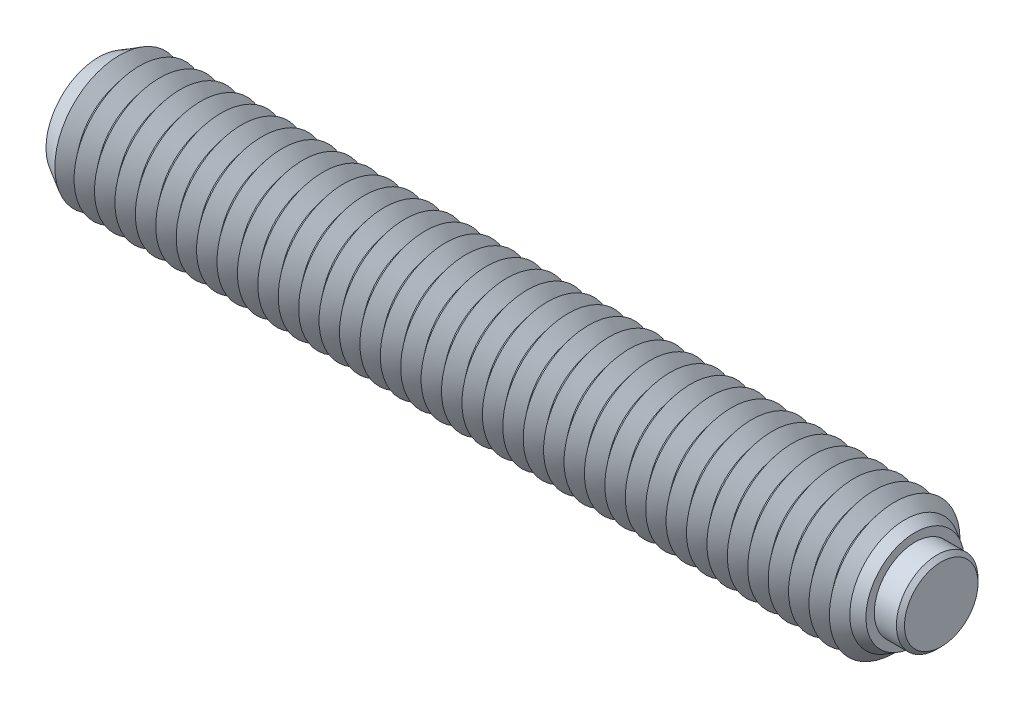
ISO-10303-21;
HEADER;
FILE_DESCRIPTION(('STEP AP214'),'2;1');
FILE_NAME('part.step','',(''),(''),'','','');
FILE_SCHEMA(('AUTOMOTIVE_DESIGN { 1 0 10303 214 1 1 1 1 }'));
ENDSEC;
DATA;
#1=APPLICATION_CONTEXT('core data for automotive mechanical design processes');
#2=APPLICATION_PROTOCOL_DEFINITION('international standard','automotive_design',2000,#1);
#3=PRODUCT_CONTEXT('',#1,'mechanical');
#4=PRODUCT('Part','Part','',(#3));
#5=PRODUCT_RELATED_PRODUCT_CATEGORY('part','',(#4));
#6=PRODUCT_DEFINITION_FORMATION('','',#4);
#7=PRODUCT_DEFINITION_CONTEXT('part definition',#1,'design');
#8=PRODUCT_DEFINITION('design','',#6,#7);
#9=PRODUCT_DEFINITION_SHAPE('','',#8);
#10=(LENGTH_UNIT() NAMED_UNIT(*) SI_UNIT(.MILLI.,.METRE.));
#11=(NAMED_UNIT(*) PLANE_ANGLE_UNIT() SI_UNIT($,.RADIAN.));
#12=(NAMED_UNIT(*) SI_UNIT($,.STERADIAN.) SOLID_ANGLE_UNIT());
#13=UNCERTAINTY_MEASURE_WITH_UNIT(LENGTH_MEASURE(1.E-05),#10,'distance_accuracy_value','');
#14=(GEOMETRIC_REPRESENTATION_CONTEXT(3) GLOBAL_UNCERTAINTY_ASSIGNED_CONTEXT((#13)) GLOBAL_UNIT_ASSIGNED_CONTEXT((#10,
#11,#12)) REPRESENTATION_CONTEXT('',''));
#15=CARTESIAN_POINT('',(0.,0.,0.));
#16=DIRECTION('',(0.,0.,1.));
#17=DIRECTION('',(1.,0.,0.));
#18=AXIS2_PLACEMENT_3D('',#15,#16,#17);
#19=CARTESIAN_POINT('',(2.225,0.,0.));
#20=DIRECTION('',(-1.,0.,0.));
#21=DIRECTION('',(0.,0.,1.));
#22=AXIS2_PLACEMENT_3D('',#19,#20,#21);
#23=CYLINDRICAL_SURFACE('',#22,2.5);
#24=CARTESIAN_POINT('',(1.975,0.,0.));
#25=DIRECTION('',(1.,0.,0.));
#26=DIRECTION('',(0.,0.,-1.));
#27=AXIS2_PLACEMENT_3D('',#24,#25,#26);
#28=CIRCLE('',#27,2.5);
#29=CARTESIAN_POINT('',(1.975,0.,-2.5));
#30=VERTEX_POINT('',#29);
#31=EDGE_CURVE('P0_E10',#30,#30,#28,.F.);
#32=ORIENTED_EDGE('',*,*,#31,.T.);
#33=EDGE_LOOP('',(#32));
#34=FACE_BOUND('',#33,.T.);
#35=CARTESIAN_POINT('',(-0.975,0.,0.));
#36=DIRECTION('',(1.,0.,0.));
#37=DIRECTION('',(0.,0.,-1.));
#38=AXIS2_PLACEMENT_3D('',#35,#36,#37);
#39=CIRCLE('',#38,2.5);
#40=CARTESIAN_POINT('',(-0.975,0.,-2.5));
#41=VERTEX_POINT('',#40);
#42=EDGE_CURVE('P0_E25',#41,#41,#39,.T.);
#43=ORIENTED_EDGE('',*,*,#42,.T.);
#44=EDGE_LOOP('',(#43));
#45=FACE_BOUND('',#44,.T.);
#46=ADVANCED_FACE('P0_F14',(#34,#45),#23,.T.);
#47=CARTESIAN_POINT('',(2.225,0.,0.));
#48=DIRECTION('',(1.,0.,0.));
#49=DIRECTION('',(0.,0.,-1.));
#50=AXIS2_PLACEMENT_3D('',#47,#48,#49);
#51=PLANE('',#50);
#52=CARTESIAN_POINT('',(2.225,0.,0.));
#53=DIRECTION('',(1.,0.,0.));
#54=DIRECTION('',(0.,0.,-1.));
#55=AXIS2_PLACEMENT_3D('',#52,#53,#54);
#56=CIRCLE('',#55,2.25);
#57=CARTESIAN_POINT('',(2.225,0.,-2.25));
#58=VERTEX_POINT('',#57);
#59=EDGE_CURVE('P0_E21',#58,#58,#56,.T.);
#60=ORIENTED_EDGE('',*,*,#59,.T.);
#61=EDGE_LOOP('',(#60));
#62=FACE_BOUND('',#61,.T.);
#63=ADVANCED_FACE('P0_F35',(#62),#51,.T.);
#64=CARTESIAN_POINT('',(-0.975,0.,0.));
#65=DIRECTION('',(1.,0.,0.));
#66=DIRECTION('',(0.,0.,-1.));
#67=AXIS2_PLACEMENT_3D('',#64,#65,#66);
#68=PLANE('',#67);
#69=ORIENTED_EDGE('',*,*,#42,.F.);
#70=EDGE_LOOP('',(#69));
#71=FACE_BOUND('',#70,.T.);
#72=ADVANCED_FACE('P0_F33',(#71),#68,.F.);
#73=CARTESIAN_POINT('',(2.225,0.,0.));
#74=DIRECTION('',(-1.,0.,0.));
#75=DIRECTION('',(0.,0.,1.));
#76=AXIS2_PLACEMENT_3D('',#73,#74,#75);
#77=CONICAL_SURFACE('',#76,2.25,0.785398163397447);
#78=ORIENTED_EDGE('',*,*,#31,.F.);
#79=EDGE_LOOP('',(#78));
#80=FACE_BOUND('',#79,.T.);
#81=ORIENTED_EDGE('',*,*,#59,.F.);
#82=EDGE_LOOP('',(#81));
#83=FACE_BOUND('',#82,.T.);
#84=ADVANCED_FACE('P0_F16',(#80,#83),#77,.T.);
#85=CLOSED_SHELL('',(#46,#63,#72,#84));
#86=MANIFOLD_SOLID_BREP('P0_B1',#85);
#87=CARTESIAN_POINT('',(-48.125,0.,0.));
#88=DIRECTION('',(-1.,0.,0.));
#89=DIRECTION('',(0.,0.,1.));
#90=AXIS2_PLACEMENT_3D('',#87,#88,#89);
#91=CONICAL_SURFACE('',#90,4.,0.895664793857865);
#92=CARTESIAN_POINT('',(-47.5,0.,0.));
#93=DIRECTION('',(1.,0.,0.));
#94=DIRECTION('',(0.,0.,-1.));
#95=AXIS2_PLACEMENT_3D('',#92,#93,#94);
#96=CIRCLE('',#95,3.2193752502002);
#97=CARTESIAN_POINT('',(-47.5,0.,-3.2193752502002));
#98=VERTEX_POINT('',#97);
#99=EDGE_CURVE('P1_E1477',#98,#98,#96,.T.);
#100=ORIENTED_EDGE('',*,*,#99,.F.);
#101=EDGE_LOOP('',(#100));
#102=FACE_BOUND('',#101,.T.);
#103=CARTESIAN_POINT('',(-48.092729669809,0.,0.));
#104=DIRECTION('',(1.,0.,0.));
#105=DIRECTION('',(0.,0.,-1.));
#106=AXIS2_PLACEMENT_3D('',#103,#104,#105);
#107=CIRCLE('',#106,3.95969437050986);
#108=CARTESIAN_POINT('',(-48.092729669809,0.,-3.95969437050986));
#109=VERTEX_POINT('',#108);
#110=EDGE_CURVE('P1_E1480',#109,#109,#107,.F.);
#111=ORIENTED_EDGE('',*,*,#110,.F.);
#112=EDGE_LOOP('',(#111));
#113=FACE_BOUND('',#112,.T.);
#114=ADVANCED_FACE('P1_F15',(#102,#113),#91,.T.);
#115=CARTESIAN_POINT('',(-1.25000000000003,0.,0.));
#116=DIRECTION('',(1.,0.,0.));
#117=DIRECTION('',(0.,0.,-1.));
#118=AXIS2_PLACEMENT_3D('',#115,#116,#117);
#119=CONICAL_SURFACE('',#118,3.2193752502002,0.895664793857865);
#120=CARTESIAN_POINT('',(-0.625000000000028,0.,0.));
#121=DIRECTION('',(1.,0.,0.));
#122=DIRECTION('',(0.,0.,-1.));
#123=AXIS2_PLACEMENT_3D('',#120,#121,#122);
#124=CIRCLE('',#123,4.);
#125=CARTESIAN_POINT('',(-0.625000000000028,0.,-4.));
#126=VERTEX_POINT('',#125);
#127=EDGE_CURVE('P1_E1251',#126,#126,#124,.T.);
#128=ORIENTED_EDGE('',*,*,#127,.F.);
#129=EDGE_LOOP('',(#128));
#130=FACE_BOUND('',#129,.T.);
#131=CARTESIAN_POINT('',(-1.25000000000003,0.,0.));
#132=DIRECTION('',(1.,0.,0.));
#133=DIRECTION('',(0.,0.,-1.));
#134=AXIS2_PLACEMENT_3D('',#131,#132,#133);
#135=CIRCLE('',#134,3.2193752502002);
#136=CARTESIAN_POINT('',(-1.25000000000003,0.,-3.2193752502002));
#137=VERTEX_POINT('',#136);
#138=EDGE_CURVE('P1_E1252',#137,#137,#135,.T.);
#139=ORIENTED_EDGE('',*,*,#138,.T.);
#140=EDGE_LOOP('',(#139));
#141=FACE_BOUND('',#140,.T.);
#142=ADVANCED_FACE('P1_F222',(#130,#141),#119,.T.);
#143=CARTESIAN_POINT('',(-1.87500000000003,0.,0.));
#144=DIRECTION('',(-1.,0.,0.));
#145=DIRECTION('',(0.,0.,1.));
#146=AXIS2_PLACEMENT_3D('',#143,#144,#145);
#147=CONICAL_SURFACE('',#146,4.,0.895664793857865);
#148=ORIENTED_EDGE('',*,*,#138,.F.);
#149=EDGE_LOOP('',(#148));
#150=FACE_BOUND('',#149,.T.);
#151=CARTESIAN_POINT('',(-1.87500000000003,0.,0.));
#152=DIRECTION('',(1.,0.,0.));
#153=DIRECTION('',(0.,0.,-1.));
#154=AXIS2_PLACEMENT_3D('',#151,#152,#153);
#155=CIRCLE('',#154,4.);
#156=CARTESIAN_POINT('',(-1.87500000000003,0.,-4.));
#157=VERTEX_POINT('',#156);
#158=EDGE_CURVE('P1_E1256',#157,#157,#155,.T.);
#159=ORIENTED_EDGE('',*,*,#158,.T.);
#160=EDGE_LOOP('',(#159));
#161=FACE_BOUND('',#160,.T.);
#162=ADVANCED_FACE('P1_F227',(#150,#161),#147,.T.);
#163=CARTESIAN_POINT('',(-0.975,0.,0.));
#164=DIRECTION('',(1.,0.,0.));
#165=DIRECTION('',(0.,1.,0.));
#166=AXIS2_PLACEMENT_3D('',#163,#164,#165);
#167=PLANE('',#166);
#168=CARTESIAN_POINT('',(-0.975,0.,0.));
#169=DIRECTION('',(1.,0.,0.));
#170=DIRECTION('',(0.,1.,0.));
#171=AXIS2_PLACEMENT_3D('',#168,#169,#170);
#172=CIRCLE('',#171,2.5);
#173=CARTESIAN_POINT('',(-0.975,2.5,0.));
#174=VERTEX_POINT('',#173);
#175=EDGE_CURVE('P1_E598',#174,#174,#172,.T.);
#176=ORIENTED_EDGE('',*,*,#175,.T.);
#177=EDGE_LOOP('',(#176));
#178=FACE_BOUND('',#177,.T.);
#179=ADVANCED_FACE('P1_F525',(#178),#167,.T.);
#180=CARTESIAN_POINT('',(-0.975,0.,0.));
#181=DIRECTION('',(1.,0.,0.));
#182=DIRECTION('',(0.,1.,0.));
#183=AXIS2_PLACEMENT_3D('',#180,#181,#182);
#184=CYLINDRICAL_SURFACE('',#183,2.5);
#185=ORIENTED_EDGE('',*,*,#175,.F.);
#186=EDGE_LOOP('',(#185));
#187=FACE_BOUND('',#186,.T.);
#188=CARTESIAN_POINT('',(0.625,0.,0.));
#189=DIRECTION('',(1.,0.,0.));
#190=DIRECTION('',(0.,1.,0.));
#191=AXIS2_PLACEMENT_3D('',#188,#189,#190);
#192=CIRCLE('',#191,2.5);
#193=CARTESIAN_POINT('',(0.625,2.5,0.));
#194=VERTEX_POINT('',#193);
#195=EDGE_CURVE('P1_E601',#194,#194,#192,.T.);
#196=ORIENTED_EDGE('',*,*,#195,.T.);
#197=EDGE_LOOP('',(#196));
#198=FACE_BOUND('',#197,.T.);
#199=ADVANCED_FACE('P1_F209',(#187,#198),#184,.F.);
#200=CARTESIAN_POINT('',(0.625,3.01415608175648,0.));
#201=DIRECTION('',(1.,0.,0.));
#202=DIRECTION('',(0.,1.,0.));
#203=AXIS2_PLACEMENT_3D('',#200,#201,#202);
#204=PLANE('',#203);
#205=ORIENTED_EDGE('',*,*,#195,.F.);
#206=EDGE_LOOP('',(#205));
#207=FACE_BOUND('',#206,.T.);
#208=CARTESIAN_POINT('',(0.625,0.,0.));
#209=DIRECTION('',(1.,0.,0.));
#210=DIRECTION('',(0.,1.,0.));
#211=AXIS2_PLACEMENT_3D('',#208,#209,#210);
#212=CIRCLE('',#211,3.01415608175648);
#213=CARTESIAN_POINT('',(0.625,3.01415608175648,0.));
#214=VERTEX_POINT('',#213);
#215=EDGE_CURVE('P1_E121',#214,#214,#212,.T.);
#216=ORIENTED_EDGE('',*,*,#215,.T.);
#217=EDGE_LOOP('',(#216));
#218=FACE_BOUND('',#217,.T.);
#219=ADVANCED_FACE('P1_F206',(#207,#218),#204,.T.);
#220=CARTESIAN_POINT('',(0.625,0.,0.));
#221=DIRECTION('',(-1.,0.,0.));
#222=DIRECTION('',(0.,-1.,0.));
#223=AXIS2_PLACEMENT_3D('',#220,#221,#222);
#224=CONICAL_SURFACE('',#223,3.01415608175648,0.523598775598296);
#225=CARTESIAN_POINT('',(0.,0.,0.));
#226=DIRECTION('',(1.,0.,0.));
#227=DIRECTION('',(0.,0.,-1.));
#228=AXIS2_PLACEMENT_3D('',#225,#226,#227);
#229=CIRCLE('',#228,3.375);
#230=CARTESIAN_POINT('',(0.,0.,-3.375));
#231=VERTEX_POINT('',#230);
#232=EDGE_CURVE('P1_E589',#231,#231,#229,.T.);
#233=ORIENTED_EDGE('',*,*,#232,.T.);
#234=EDGE_LOOP('',(#233));
#235=FACE_BOUND('',#234,.T.);
#236=ORIENTED_EDGE('',*,*,#215,.F.);
#237=EDGE_LOOP('',(#236));
#238=FACE_BOUND('',#237,.T.);
#239=ADVANCED_FACE('P1_F203',(#235,#238),#224,.T.);
#240=CARTESIAN_POINT('',(0.,0.,0.));
#241=DIRECTION('',(-1.,0.,0.));
#242=DIRECTION('',(0.,0.,1.));
#243=AXIS2_PLACEMENT_3D('',#240,#241,#242);
#244=CONICAL_SURFACE('',#243,3.375,0.785398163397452);
#245=ORIENTED_EDGE('',*,*,#127,.T.);
#246=EDGE_LOOP('',(#245));
#247=FACE_BOUND('',#246,.T.);
#248=ORIENTED_EDGE('',*,*,#232,.F.);
#249=EDGE_LOOP('',(#248));
#250=FACE_BOUND('',#249,.T.);
#251=ADVANCED_FACE('P1_F17',(#247,#250),#244,.T.);
#252=CARTESIAN_POINT('',(-2.50000000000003,0.,0.));
#253=DIRECTION('',(1.,0.,0.));
#254=DIRECTION('',(0.,0.,-1.));
#255=AXIS2_PLACEMENT_3D('',#252,#253,#254);
#256=CONICAL_SURFACE('',#255,3.2193752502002,0.895664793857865);
#257=ORIENTED_EDGE('',*,*,#158,.F.);
#258=EDGE_LOOP('',(#257));
#259=FACE_BOUND('',#258,.T.);
#260=CARTESIAN_POINT('',(-2.50000000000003,0.,0.));
#261=DIRECTION('',(1.,0.,0.));
#262=DIRECTION('',(0.,0.,-1.));
#263=AXIS2_PLACEMENT_3D('',#260,#261,#262);
#264=CIRCLE('',#263,3.2193752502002);
#265=CARTESIAN_POINT('',(-2.50000000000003,0.,-3.2193752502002));
#266=VERTEX_POINT('',#265);
#267=EDGE_CURVE('P1_E1261',#266,#266,#264,.T.);
#268=ORIENTED_EDGE('',*,*,#267,.T.);
#269=EDGE_LOOP('',(#268));
#270=FACE_BOUND('',#269,.T.);
#271=ADVANCED_FACE('P1_F519',(#259,#270),#256,.T.);
#272=CARTESIAN_POINT('',(-3.12500000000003,0.,0.));
#273=DIRECTION('',(-1.,0.,0.));
#274=DIRECTION('',(0.,0.,1.));
#275=AXIS2_PLACEMENT_3D('',#272,#273,#274);
#276=CONICAL_SURFACE('',#275,4.,0.895664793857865);
#277=ORIENTED_EDGE('',*,*,#267,.F.);
#278=EDGE_LOOP('',(#277));
#279=FACE_BOUND('',#278,.T.);
#280=CARTESIAN_POINT('',(-3.12500000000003,0.,0.));
#281=DIRECTION('',(1.,0.,0.));
#282=DIRECTION('',(0.,0.,-1.));
#283=AXIS2_PLACEMENT_3D('',#280,#281,#282);
#284=CIRCLE('',#283,4.);
#285=CARTESIAN_POINT('',(-3.12500000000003,0.,-4.));
#286=VERTEX_POINT('',#285);
#287=EDGE_CURVE('P1_E1264',#286,#286,#284,.T.);
#288=ORIENTED_EDGE('',*,*,#287,.T.);
#289=EDGE_LOOP('',(#288));
#290=FACE_BOUND('',#289,.T.);
#291=ADVANCED_FACE('P1_F515',(#279,#290),#276,.T.);
#292=CARTESIAN_POINT('',(-3.75000000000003,0.,0.));
#293=DIRECTION('',(1.,0.,0.));
#294=DIRECTION('',(0.,0.,-1.));
#295=AXIS2_PLACEMENT_3D('',#292,#293,#294);
#296=CONICAL_SURFACE('',#295,3.2193752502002,0.895664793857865);
#297=ORIENTED_EDGE('',*,*,#287,.F.);
#298=EDGE_LOOP('',(#297));
#299=FACE_BOUND('',#298,.T.);
#300=CARTESIAN_POINT('',(-3.75000000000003,0.,0.));
#301=DIRECTION('',(1.,0.,0.));
#302=DIRECTION('',(0.,0.,-1.));
#303=AXIS2_PLACEMENT_3D('',#300,#301,#302);
#304=CIRCLE('',#303,3.2193752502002);
#305=CARTESIAN_POINT('',(-3.75000000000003,0.,-3.2193752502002));
#306=VERTEX_POINT('',#305);
#307=EDGE_CURVE('P1_E1267',#306,#306,#304,.T.);
#308=ORIENTED_EDGE('',*,*,#307,.T.);
#309=EDGE_LOOP('',(#308));
#310=FACE_BOUND('',#309,.T.);
#311=ADVANCED_FACE('P1_F511',(#299,#310),#296,.T.);
#312=CARTESIAN_POINT('',(-4.37500000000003,0.,0.));
#313=DIRECTION('',(-1.,0.,0.));
#314=DIRECTION('',(0.,0.,1.));
#315=AXIS2_PLACEMENT_3D('',#312,#313,#314);
#316=CONICAL_SURFACE('',#315,4.,0.895664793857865);
#317=ORIENTED_EDGE('',*,*,#307,.F.);
#318=EDGE_LOOP('',(#317));
#319=FACE_BOUND('',#318,.T.);
#320=CARTESIAN_POINT('',(-4.37500000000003,0.,0.));
#321=DIRECTION('',(1.,0.,0.));
#322=DIRECTION('',(0.,0.,-1.));
#323=AXIS2_PLACEMENT_3D('',#320,#321,#322);
#324=CIRCLE('',#323,4.);
#325=CARTESIAN_POINT('',(-4.37500000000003,0.,-4.));
#326=VERTEX_POINT('',#325);
#327=EDGE_CURVE('P1_E1270',#326,#326,#324,.T.);
#328=ORIENTED_EDGE('',*,*,#327,.T.);
#329=EDGE_LOOP('',(#328));
#330=FACE_BOUND('',#329,.T.);
#331=ADVANCED_FACE('P1_F507',(#319,#330),#316,.T.);
#332=CARTESIAN_POINT('',(-5.00000000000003,0.,0.));
#333=DIRECTION('',(1.,0.,0.));
#334=DIRECTION('',(0.,0.,-1.));
#335=AXIS2_PLACEMENT_3D('',#332,#333,#334);
#336=CONICAL_SURFACE('',#335,3.2193752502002,0.895664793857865);
#337=ORIENTED_EDGE('',*,*,#327,.F.);
#338=EDGE_LOOP('',(#337));
#339=FACE_BOUND('',#338,.T.);
#340=CARTESIAN_POINT('',(-5.00000000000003,0.,0.));
#341=DIRECTION('',(1.,0.,0.));
#342=DIRECTION('',(0.,0.,-1.));
#343=AXIS2_PLACEMENT_3D('',#340,#341,#342);
#344=CIRCLE('',#343,3.2193752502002);
#345=CARTESIAN_POINT('',(-5.00000000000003,0.,-3.2193752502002));
#346=VERTEX_POINT('',#345);
#347=EDGE_CURVE('P1_E1273',#346,#346,#344,.T.);
#348=ORIENTED_EDGE('',*,*,#347,.T.);
#349=EDGE_LOOP('',(#348));
#350=FACE_BOUND('',#349,.T.);
#351=ADVANCED_FACE('P1_F503',(#339,#350),#336,.T.);
#352=CARTESIAN_POINT('',(-5.62500000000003,0.,0.));
#353=DIRECTION('',(-1.,0.,0.));
#354=DIRECTION('',(0.,0.,1.));
#355=AXIS2_PLACEMENT_3D('',#352,#353,#354);
#356=CONICAL_SURFACE('',#355,4.,0.895664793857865);
#357=ORIENTED_EDGE('',*,*,#347,.F.);
#358=EDGE_LOOP('',(#357));
#359=FACE_BOUND('',#358,.T.);
#360=CARTESIAN_POINT('',(-5.62500000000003,0.,0.));
#361=DIRECTION('',(1.,0.,0.));
#362=DIRECTION('',(0.,0.,-1.));
#363=AXIS2_PLACEMENT_3D('',#360,#361,#362);
#364=CIRCLE('',#363,4.);
#365=CARTESIAN_POINT('',(-5.62500000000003,0.,-4.));
#366=VERTEX_POINT('',#365);
#367=EDGE_CURVE('P1_E1276',#366,#366,#364,.T.);
#368=ORIENTED_EDGE('',*,*,#367,.T.);
#369=EDGE_LOOP('',(#368));
#370=FACE_BOUND('',#369,.T.);
#371=ADVANCED_FACE('P1_F499',(#359,#370),#356,.T.);
#372=CARTESIAN_POINT('',(-6.25000000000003,0.,0.));
#373=DIRECTION('',(1.,0.,0.));
#374=DIRECTION('',(0.,0.,-1.));
#375=AXIS2_PLACEMENT_3D('',#372,#373,#374);
#376=CONICAL_SURFACE('',#375,3.2193752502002,0.895664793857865);
#377=ORIENTED_EDGE('',*,*,#367,.F.);
#378=EDGE_LOOP('',(#377));
#379=FACE_BOUND('',#378,.T.);
#380=CARTESIAN_POINT('',(-6.25000000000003,0.,0.));
#381=DIRECTION('',(1.,0.,0.));
#382=DIRECTION('',(0.,0.,-1.));
#383=AXIS2_PLACEMENT_3D('',#380,#381,#382);
#384=CIRCLE('',#383,3.2193752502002);
#385=CARTESIAN_POINT('',(-6.25000000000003,0.,-3.2193752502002));
#386=VERTEX_POINT('',#385);
#387=EDGE_CURVE('P1_E1279',#386,#386,#384,.T.);
#388=ORIENTED_EDGE('',*,*,#387,.T.);
#389=EDGE_LOOP('',(#388));
#390=FACE_BOUND('',#389,.T.);
#391=ADVANCED_FACE('P1_F495',(#379,#390),#376,.T.);
#392=CARTESIAN_POINT('',(-6.87500000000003,0.,0.));
#393=DIRECTION('',(-1.,0.,0.));
#394=DIRECTION('',(0.,0.,1.));
#395=AXIS2_PLACEMENT_3D('',#392,#393,#394);
#396=CONICAL_SURFACE('',#395,4.,0.895664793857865);
#397=ORIENTED_EDGE('',*,*,#387,.F.);
#398=EDGE_LOOP('',(#397));
#399=FACE_BOUND('',#398,.T.);
#400=CARTESIAN_POINT('',(-6.87500000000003,0.,0.));
#401=DIRECTION('',(1.,0.,0.));
#402=DIRECTION('',(0.,0.,-1.));
#403=AXIS2_PLACEMENT_3D('',#400,#401,#402);
#404=CIRCLE('',#403,4.);
#405=CARTESIAN_POINT('',(-6.87500000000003,0.,-4.));
#406=VERTEX_POINT('',#405);
#407=EDGE_CURVE('P1_E1282',#406,#406,#404,.T.);
#408=ORIENTED_EDGE('',*,*,#407,.T.);
#409=EDGE_LOOP('',(#408));
#410=FACE_BOUND('',#409,.T.);
#411=ADVANCED_FACE('P1_F491',(#399,#410),#396,.T.);
#412=CARTESIAN_POINT('',(-7.50000000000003,0.,0.));
#413=DIRECTION('',(1.,0.,0.));
#414=DIRECTION('',(0.,0.,-1.));
#415=AXIS2_PLACEMENT_3D('',#412,#413,#414);
#416=CONICAL_SURFACE('',#415,3.2193752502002,0.895664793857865);
#417=ORIENTED_EDGE('',*,*,#407,.F.);
#418=EDGE_LOOP('',(#417));
#419=FACE_BOUND('',#418,.T.);
#420=CARTESIAN_POINT('',(-7.50000000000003,0.,0.));
#421=DIRECTION('',(1.,0.,0.));
#422=DIRECTION('',(0.,0.,-1.));
#423=AXIS2_PLACEMENT_3D('',#420,#421,#422);
#424=CIRCLE('',#423,3.2193752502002);
#425=CARTESIAN_POINT('',(-7.50000000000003,0.,-3.2193752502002));
#426=VERTEX_POINT('',#425);
#427=EDGE_CURVE('P1_E1285',#426,#426,#424,.T.);
#428=ORIENTED_EDGE('',*,*,#427,.T.);
#429=EDGE_LOOP('',(#428));
#430=FACE_BOUND('',#429,.T.);
#431=ADVANCED_FACE('P1_F487',(#419,#430),#416,.T.);
#432=CARTESIAN_POINT('',(-8.12500000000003,0.,0.));
#433=DIRECTION('',(-1.,0.,0.));
#434=DIRECTION('',(0.,0.,1.));
#435=AXIS2_PLACEMENT_3D('',#432,#433,#434);
#436=CONICAL_SURFACE('',#435,4.,0.895664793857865);
#437=ORIENTED_EDGE('',*,*,#427,.F.);
#438=EDGE_LOOP('',(#437));
#439=FACE_BOUND('',#438,.T.);
#440=CARTESIAN_POINT('',(-8.12500000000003,0.,0.));
#441=DIRECTION('',(1.,0.,0.));
#442=DIRECTION('',(0.,0.,-1.));
#443=AXIS2_PLACEMENT_3D('',#440,#441,#442);
#444=CIRCLE('',#443,4.);
#445=CARTESIAN_POINT('',(-8.12500000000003,0.,-4.));
#446=VERTEX_POINT('',#445);
#447=EDGE_CURVE('P1_E1288',#446,#446,#444,.T.);
#448=ORIENTED_EDGE('',*,*,#447,.T.);
#449=EDGE_LOOP('',(#448));
#450=FACE_BOUND('',#449,.T.);
#451=ADVANCED_FACE('P1_F483',(#439,#450),#436,.T.);
#452=CARTESIAN_POINT('',(-8.75000000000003,0.,0.));
#453=DIRECTION('',(1.,0.,0.));
#454=DIRECTION('',(0.,0.,-1.));
#455=AXIS2_PLACEMENT_3D('',#452,#453,#454);
#456=CONICAL_SURFACE('',#455,3.2193752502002,0.895664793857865);
#457=ORIENTED_EDGE('',*,*,#447,.F.);
#458=EDGE_LOOP('',(#457));
#459=FACE_BOUND('',#458,.T.);
#460=CARTESIAN_POINT('',(-8.75000000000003,0.,0.));
#461=DIRECTION('',(1.,0.,0.));
#462=DIRECTION('',(0.,0.,-1.));
#463=AXIS2_PLACEMENT_3D('',#460,#461,#462);
#464=CIRCLE('',#463,3.2193752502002);
#465=CARTESIAN_POINT('',(-8.75000000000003,0.,-3.2193752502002));
#466=VERTEX_POINT('',#465);
#467=EDGE_CURVE('P1_E1291',#466,#466,#464,.T.);
#468=ORIENTED_EDGE('',*,*,#467,.T.);
#469=EDGE_LOOP('',(#468));
#470=FACE_BOUND('',#469,.T.);
#471=ADVANCED_FACE('P1_F479',(#459,#470),#456,.T.);
#472=CARTESIAN_POINT('',(-9.37500000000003,0.,0.));
#473=DIRECTION('',(-1.,0.,0.));
#474=DIRECTION('',(0.,0.,1.));
#475=AXIS2_PLACEMENT_3D('',#472,#473,#474);
#476=CONICAL_SURFACE('',#475,4.,0.895664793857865);
#477=ORIENTED_EDGE('',*,*,#467,.F.);
#478=EDGE_LOOP('',(#477));
#479=FACE_BOUND('',#478,.T.);
#480=CARTESIAN_POINT('',(-9.37500000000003,0.,0.));
#481=DIRECTION('',(1.,0.,0.));
#482=DIRECTION('',(0.,0.,-1.));
#483=AXIS2_PLACEMENT_3D('',#480,#481,#482);
#484=CIRCLE('',#483,4.);
#485=CARTESIAN_POINT('',(-9.37500000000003,0.,-4.));
#486=VERTEX_POINT('',#485);
#487=EDGE_CURVE('P1_E1294',#486,#486,#484,.T.);
#488=ORIENTED_EDGE('',*,*,#487,.T.);
#489=EDGE_LOOP('',(#488));
#490=FACE_BOUND('',#489,.T.);
#491=ADVANCED_FACE('P1_F475',(#479,#490),#476,.T.);
#492=CARTESIAN_POINT('',(-10.,0.,0.));
#493=DIRECTION('',(1.,0.,0.));
#494=DIRECTION('',(0.,0.,-1.));
#495=AXIS2_PLACEMENT_3D('',#492,#493,#494);
#496=CONICAL_SURFACE('',#495,3.2193752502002,0.895664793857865);
#497=ORIENTED_EDGE('',*,*,#487,.F.);
#498=EDGE_LOOP('',(#497));
#499=FACE_BOUND('',#498,.T.);
#500=CARTESIAN_POINT('',(-10.,0.,0.));
#501=DIRECTION('',(1.,0.,0.));
#502=DIRECTION('',(0.,0.,-1.));
#503=AXIS2_PLACEMENT_3D('',#500,#501,#502);
#504=CIRCLE('',#503,3.2193752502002);
#505=CARTESIAN_POINT('',(-10.,0.,-3.2193752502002));
#506=VERTEX_POINT('',#505);
#507=EDGE_CURVE('P1_E1297',#506,#506,#504,.T.);
#508=ORIENTED_EDGE('',*,*,#507,.T.);
#509=EDGE_LOOP('',(#508));
#510=FACE_BOUND('',#509,.T.);
#511=ADVANCED_FACE('P1_F471',(#499,#510),#496,.T.);
#512=CARTESIAN_POINT('',(-10.625,0.,0.));
#513=DIRECTION('',(-1.,0.,0.));
#514=DIRECTION('',(0.,0.,1.));
#515=AXIS2_PLACEMENT_3D('',#512,#513,#514);
#516=CONICAL_SURFACE('',#515,4.,0.895664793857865);
#517=ORIENTED_EDGE('',*,*,#507,.F.);
#518=EDGE_LOOP('',(#517));
#519=FACE_BOUND('',#518,.T.);
#520=CARTESIAN_POINT('',(-10.625,0.,0.));
#521=DIRECTION('',(1.,0.,0.));
#522=DIRECTION('',(0.,0.,-1.));
#523=AXIS2_PLACEMENT_3D('',#520,#521,#522);
#524=CIRCLE('',#523,4.);
#525=CARTESIAN_POINT('',(-10.625,0.,-4.));
#526=VERTEX_POINT('',#525);
#527=EDGE_CURVE('P1_E1300',#526,#526,#524,.T.);
#528=ORIENTED_EDGE('',*,*,#527,.T.);
#529=EDGE_LOOP('',(#528));
#530=FACE_BOUND('',#529,.T.);
#531=ADVANCED_FACE('P1_F467',(#519,#530),#516,.T.);
#532=CARTESIAN_POINT('',(-11.25,0.,0.));
#533=DIRECTION('',(1.,0.,0.));
#534=DIRECTION('',(0.,0.,-1.));
#535=AXIS2_PLACEMENT_3D('',#532,#533,#534);
#536=CONICAL_SURFACE('',#535,3.2193752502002,0.895664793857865);
#537=ORIENTED_EDGE('',*,*,#527,.F.);
#538=EDGE_LOOP('',(#537));
#539=FACE_BOUND('',#538,.T.);
#540=CARTESIAN_POINT('',(-11.25,0.,0.));
#541=DIRECTION('',(1.,0.,0.));
#542=DIRECTION('',(0.,0.,-1.));
#543=AXIS2_PLACEMENT_3D('',#540,#541,#542);
#544=CIRCLE('',#543,3.2193752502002);
#545=CARTESIAN_POINT('',(-11.25,0.,-3.2193752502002));
#546=VERTEX_POINT('',#545);
#547=EDGE_CURVE('P1_E1303',#546,#546,#544,.T.);
#548=ORIENTED_EDGE('',*,*,#547,.T.);
#549=EDGE_LOOP('',(#548));
#550=FACE_BOUND('',#549,.T.);
#551=ADVANCED_FACE('P1_F463',(#539,#550),#536,.T.);
#552=CARTESIAN_POINT('',(-11.875,0.,0.));
#553=DIRECTION('',(-1.,0.,0.));
#554=DIRECTION('',(0.,0.,1.));
#555=AXIS2_PLACEMENT_3D('',#552,#553,#554);
#556=CONICAL_SURFACE('',#555,4.,0.895664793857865);
#557=ORIENTED_EDGE('',*,*,#547,.F.);
#558=EDGE_LOOP('',(#557));
#559=FACE_BOUND('',#558,.T.);
#560=CARTESIAN_POINT('',(-11.875,0.,0.));
#561=DIRECTION('',(1.,0.,0.));
#562=DIRECTION('',(0.,0.,-1.));
#563=AXIS2_PLACEMENT_3D('',#560,#561,#562);
#564=CIRCLE('',#563,4.);
#565=CARTESIAN_POINT('',(-11.875,0.,-4.));
#566=VERTEX_POINT('',#565);
#567=EDGE_CURVE('P1_E1306',#566,#566,#564,.T.);
#568=ORIENTED_EDGE('',*,*,#567,.T.);
#569=EDGE_LOOP('',(#568));
#570=FACE_BOUND('',#569,.T.);
#571=ADVANCED_FACE('P1_F459',(#559,#570),#556,.T.);
#572=CARTESIAN_POINT('',(-12.5,0.,0.));
#573=DIRECTION('',(1.,0.,0.));
#574=DIRECTION('',(0.,0.,-1.));
#575=AXIS2_PLACEMENT_3D('',#572,#573,#574);
#576=CONICAL_SURFACE('',#575,3.2193752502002,0.895664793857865);
#577=ORIENTED_EDGE('',*,*,#567,.F.);
#578=EDGE_LOOP('',(#577));
#579=FACE_BOUND('',#578,.T.);
#580=CARTESIAN_POINT('',(-12.5,0.,0.));
#581=DIRECTION('',(1.,0.,0.));
#582=DIRECTION('',(0.,0.,-1.));
#583=AXIS2_PLACEMENT_3D('',#580,#581,#582);
#584=CIRCLE('',#583,3.2193752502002);
#585=CARTESIAN_POINT('',(-12.5,0.,-3.2193752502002));
#586=VERTEX_POINT('',#585);
#587=EDGE_CURVE('P1_E1309',#586,#586,#584,.T.);
#588=ORIENTED_EDGE('',*,*,#587,.T.);
#589=EDGE_LOOP('',(#588));
#590=FACE_BOUND('',#589,.T.);
#591=ADVANCED_FACE('P1_F455',(#579,#590),#576,.T.);
#592=CARTESIAN_POINT('',(-13.125,0.,0.));
#593=DIRECTION('',(-1.,0.,0.));
#594=DIRECTION('',(0.,0.,1.));
#595=AXIS2_PLACEMENT_3D('',#592,#593,#594);
#596=CONICAL_SURFACE('',#595,4.,0.895664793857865);
#597=ORIENTED_EDGE('',*,*,#587,.F.);
#598=EDGE_LOOP('',(#597));
#599=FACE_BOUND('',#598,.T.);
#600=CARTESIAN_POINT('',(-13.125,0.,0.));
#601=DIRECTION('',(1.,0.,0.));
#602=DIRECTION('',(0.,0.,-1.));
#603=AXIS2_PLACEMENT_3D('',#600,#601,#602);
#604=CIRCLE('',#603,4.);
#605=CARTESIAN_POINT('',(-13.125,0.,-4.));
#606=VERTEX_POINT('',#605);
#607=EDGE_CURVE('P1_E1312',#606,#606,#604,.T.);
#608=ORIENTED_EDGE('',*,*,#607,.T.);
#609=EDGE_LOOP('',(#608));
#610=FACE_BOUND('',#609,.T.);
#611=ADVANCED_FACE('P1_F451',(#599,#610),#596,.T.);
#612=CARTESIAN_POINT('',(-13.75,0.,0.));
#613=DIRECTION('',(1.,0.,0.));
#614=DIRECTION('',(0.,0.,-1.));
#615=AXIS2_PLACEMENT_3D('',#612,#613,#614);
#616=CONICAL_SURFACE('',#615,3.2193752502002,0.895664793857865);
#617=ORIENTED_EDGE('',*,*,#607,.F.);
#618=EDGE_LOOP('',(#617));
#619=FACE_BOUND('',#618,.T.);
#620=CARTESIAN_POINT('',(-13.75,0.,0.));
#621=DIRECTION('',(1.,0.,0.));
#622=DIRECTION('',(0.,0.,-1.));
#623=AXIS2_PLACEMENT_3D('',#620,#621,#622);
#624=CIRCLE('',#623,3.2193752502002);
#625=CARTESIAN_POINT('',(-13.75,0.,-3.2193752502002));
#626=VERTEX_POINT('',#625);
#627=EDGE_CURVE('P1_E1315',#626,#626,#624,.T.);
#628=ORIENTED_EDGE('',*,*,#627,.T.);
#629=EDGE_LOOP('',(#628));
#630=FACE_BOUND('',#629,.T.);
#631=ADVANCED_FACE('P1_F447',(#619,#630),#616,.T.);
#632=CARTESIAN_POINT('',(-14.375,0.,0.));
#633=DIRECTION('',(-1.,0.,0.));
#634=DIRECTION('',(0.,0.,1.));
#635=AXIS2_PLACEMENT_3D('',#632,#633,#634);
#636=CONICAL_SURFACE('',#635,4.,0.895664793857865);
#637=ORIENTED_EDGE('',*,*,#627,.F.);
#638=EDGE_LOOP('',(#637));
#639=FACE_BOUND('',#638,.T.);
#640=CARTESIAN_POINT('',(-14.375,0.,0.));
#641=DIRECTION('',(1.,0.,0.));
#642=DIRECTION('',(0.,0.,-1.));
#643=AXIS2_PLACEMENT_3D('',#640,#641,#642);
#644=CIRCLE('',#643,4.);
#645=CARTESIAN_POINT('',(-14.375,0.,-4.));
#646=VERTEX_POINT('',#645);
#647=EDGE_CURVE('P1_E1318',#646,#646,#644,.T.);
#648=ORIENTED_EDGE('',*,*,#647,.T.);
#649=EDGE_LOOP('',(#648));
#650=FACE_BOUND('',#649,.T.);
#651=ADVANCED_FACE('P1_F443',(#639,#650),#636,.T.);
#652=CARTESIAN_POINT('',(-15.,0.,0.));
#653=DIRECTION('',(1.,0.,0.));
#654=DIRECTION('',(0.,0.,-1.));
#655=AXIS2_PLACEMENT_3D('',#652,#653,#654);
#656=CONICAL_SURFACE('',#655,3.2193752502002,0.895664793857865);
#657=ORIENTED_EDGE('',*,*,#647,.F.);
#658=EDGE_LOOP('',(#657));
#659=FACE_BOUND('',#658,.T.);
#660=CARTESIAN_POINT('',(-15.,0.,0.));
#661=DIRECTION('',(1.,0.,0.));
#662=DIRECTION('',(0.,0.,-1.));
#663=AXIS2_PLACEMENT_3D('',#660,#661,#662);
#664=CIRCLE('',#663,3.2193752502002);
#665=CARTESIAN_POINT('',(-15.,0.,-3.2193752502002));
#666=VERTEX_POINT('',#665);
#667=EDGE_CURVE('P1_E1321',#666,#666,#664,.T.);
#668=ORIENTED_EDGE('',*,*,#667,.T.);
#669=EDGE_LOOP('',(#668));
#670=FACE_BOUND('',#669,.T.);
#671=ADVANCED_FACE('P1_F439',(#659,#670),#656,.T.);
#672=CARTESIAN_POINT('',(-15.625,0.,0.));
#673=DIRECTION('',(-1.,0.,0.));
#674=DIRECTION('',(0.,0.,1.));
#675=AXIS2_PLACEMENT_3D('',#672,#673,#674);
#676=CONICAL_SURFACE('',#675,4.,0.895664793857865);
#677=ORIENTED_EDGE('',*,*,#667,.F.);
#678=EDGE_LOOP('',(#677));
#679=FACE_BOUND('',#678,.T.);
#680=CARTESIAN_POINT('',(-15.625,0.,0.));
#681=DIRECTION('',(1.,0.,0.));
#682=DIRECTION('',(0.,0.,-1.));
#683=AXIS2_PLACEMENT_3D('',#680,#681,#682);
#684=CIRCLE('',#683,4.);
#685=CARTESIAN_POINT('',(-15.625,0.,-4.));
#686=VERTEX_POINT('',#685);
#687=EDGE_CURVE('P1_E1324',#686,#686,#684,.T.);
#688=ORIENTED_EDGE('',*,*,#687,.T.);
#689=EDGE_LOOP('',(#688));
#690=FACE_BOUND('',#689,.T.);
#691=ADVANCED_FACE('P1_F435',(#679,#690),#676,.T.);
#692=CARTESIAN_POINT('',(-16.25,0.,0.));
#693=DIRECTION('',(1.,0.,0.));
#694=DIRECTION('',(0.,0.,-1.));
#695=AXIS2_PLACEMENT_3D('',#692,#693,#694);
#696=CONICAL_SURFACE('',#695,3.2193752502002,0.895664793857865);
#697=ORIENTED_EDGE('',*,*,#687,.F.);
#698=EDGE_LOOP('',(#697));
#699=FACE_BOUND('',#698,.T.);
#700=CARTESIAN_POINT('',(-16.25,0.,0.));
#701=DIRECTION('',(1.,0.,0.));
#702=DIRECTION('',(0.,0.,-1.));
#703=AXIS2_PLACEMENT_3D('',#700,#701,#702);
#704=CIRCLE('',#703,3.2193752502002);
#705=CARTESIAN_POINT('',(-16.25,0.,-3.2193752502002));
#706=VERTEX_POINT('',#705);
#707=EDGE_CURVE('P1_E1327',#706,#706,#704,.T.);
#708=ORIENTED_EDGE('',*,*,#707,.T.);
#709=EDGE_LOOP('',(#708));
#710=FACE_BOUND('',#709,.T.);
#711=ADVANCED_FACE('P1_F431',(#699,#710),#696,.T.);
#712=CARTESIAN_POINT('',(-16.875,0.,0.));
#713=DIRECTION('',(-1.,0.,0.));
#714=DIRECTION('',(0.,0.,1.));
#715=AXIS2_PLACEMENT_3D('',#712,#713,#714);
#716=CONICAL_SURFACE('',#715,4.,0.895664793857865);
#717=ORIENTED_EDGE('',*,*,#707,.F.);
#718=EDGE_LOOP('',(#717));
#719=FACE_BOUND('',#718,.T.);
#720=CARTESIAN_POINT('',(-16.875,0.,0.));
#721=DIRECTION('',(1.,0.,0.));
#722=DIRECTION('',(0.,0.,-1.));
#723=AXIS2_PLACEMENT_3D('',#720,#721,#722);
#724=CIRCLE('',#723,4.);
#725=CARTESIAN_POINT('',(-16.875,0.,-4.));
#726=VERTEX_POINT('',#725);
#727=EDGE_CURVE('P1_E1330',#726,#726,#724,.T.);
#728=ORIENTED_EDGE('',*,*,#727,.T.);
#729=EDGE_LOOP('',(#728));
#730=FACE_BOUND('',#729,.T.);
#731=ADVANCED_FACE('P1_F427',(#719,#730),#716,.T.);
#732=CARTESIAN_POINT('',(-17.5,0.,0.));
#733=DIRECTION('',(1.,0.,0.));
#734=DIRECTION('',(0.,0.,-1.));
#735=AXIS2_PLACEMENT_3D('',#732,#733,#734);
#736=CONICAL_SURFACE('',#735,3.2193752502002,0.895664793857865);
#737=ORIENTED_EDGE('',*,*,#727,.F.);
#738=EDGE_LOOP('',(#737));
#739=FACE_BOUND('',#738,.T.);
#740=CARTESIAN_POINT('',(-17.5,0.,0.));
#741=DIRECTION('',(1.,0.,0.));
#742=DIRECTION('',(0.,0.,-1.));
#743=AXIS2_PLACEMENT_3D('',#740,#741,#742);
#744=CIRCLE('',#743,3.2193752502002);
#745=CARTESIAN_POINT('',(-17.5,0.,-3.2193752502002));
#746=VERTEX_POINT('',#745);
#747=EDGE_CURVE('P1_E1333',#746,#746,#744,.T.);
#748=ORIENTED_EDGE('',*,*,#747,.T.);
#749=EDGE_LOOP('',(#748));
#750=FACE_BOUND('',#749,.T.);
#751=ADVANCED_FACE('P1_F423',(#739,#750),#736,.T.);
#752=CARTESIAN_POINT('',(-18.125,0.,0.));
#753=DIRECTION('',(-1.,0.,0.));
#754=DIRECTION('',(0.,0.,1.));
#755=AXIS2_PLACEMENT_3D('',#752,#753,#754);
#756=CONICAL_SURFACE('',#755,4.,0.895664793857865);
#757=ORIENTED_EDGE('',*,*,#747,.F.);
#758=EDGE_LOOP('',(#757));
#759=FACE_BOUND('',#758,.T.);
#760=CARTESIAN_POINT('',(-18.125,0.,0.));
#761=DIRECTION('',(1.,0.,0.));
#762=DIRECTION('',(0.,0.,-1.));
#763=AXIS2_PLACEMENT_3D('',#760,#761,#762);
#764=CIRCLE('',#763,4.);
#765=CARTESIAN_POINT('',(-18.125,0.,-4.));
#766=VERTEX_POINT('',#765);
#767=EDGE_CURVE('P1_E1336',#766,#766,#764,.T.);
#768=ORIENTED_EDGE('',*,*,#767,.T.);
#769=EDGE_LOOP('',(#768));
#770=FACE_BOUND('',#769,.T.);
#771=ADVANCED_FACE('P1_F419',(#759,#770),#756,.T.);
#772=CARTESIAN_POINT('',(-18.75,0.,0.));
#773=DIRECTION('',(1.,0.,0.));
#774=DIRECTION('',(0.,0.,-1.));
#775=AXIS2_PLACEMENT_3D('',#772,#773,#774);
#776=CONICAL_SURFACE('',#775,3.2193752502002,0.895664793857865);
#777=ORIENTED_EDGE('',*,*,#767,.F.);
#778=EDGE_LOOP('',(#777));
#779=FACE_BOUND('',#778,.T.);
#780=CARTESIAN_POINT('',(-18.75,0.,0.));
#781=DIRECTION('',(1.,0.,0.));
#782=DIRECTION('',(0.,0.,-1.));
#783=AXIS2_PLACEMENT_3D('',#780,#781,#782);
#784=CIRCLE('',#783,3.2193752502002);
#785=CARTESIAN_POINT('',(-18.75,0.,-3.2193752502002));
#786=VERTEX_POINT('',#785);
#787=EDGE_CURVE('P1_E1339',#786,#786,#784,.T.);
#788=ORIENTED_EDGE('',*,*,#787,.T.);
#789=EDGE_LOOP('',(#788));
#790=FACE_BOUND('',#789,.T.);
#791=ADVANCED_FACE('P1_F415',(#779,#790),#776,.T.);
#792=CARTESIAN_POINT('',(-19.375,0.,0.));
#793=DIRECTION('',(-1.,0.,0.));
#794=DIRECTION('',(0.,0.,1.));
#795=AXIS2_PLACEMENT_3D('',#792,#793,#794);
#796=CONICAL_SURFACE('',#795,4.,0.895664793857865);
#797=ORIENTED_EDGE('',*,*,#787,.F.);
#798=EDGE_LOOP('',(#797));
#799=FACE_BOUND('',#798,.T.);
#800=CARTESIAN_POINT('',(-19.375,0.,0.));
#801=DIRECTION('',(1.,0.,0.));
#802=DIRECTION('',(0.,0.,-1.));
#803=AXIS2_PLACEMENT_3D('',#800,#801,#802);
#804=CIRCLE('',#803,4.);
#805=CARTESIAN_POINT('',(-19.375,0.,-4.));
#806=VERTEX_POINT('',#805);
#807=EDGE_CURVE('P1_E1342',#806,#806,#804,.T.);
#808=ORIENTED_EDGE('',*,*,#807,.T.);
#809=EDGE_LOOP('',(#808));
#810=FACE_BOUND('',#809,.T.);
#811=ADVANCED_FACE('P1_F411',(#799,#810),#796,.T.);
#812=CARTESIAN_POINT('',(-20.,0.,0.));
#813=DIRECTION('',(1.,0.,0.));
#814=DIRECTION('',(0.,0.,-1.));
#815=AXIS2_PLACEMENT_3D('',#812,#813,#814);
#816=CONICAL_SURFACE('',#815,3.2193752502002,0.895664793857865);
#817=ORIENTED_EDGE('',*,*,#807,.F.);
#818=EDGE_LOOP('',(#817));
#819=FACE_BOUND('',#818,.T.);
#820=CARTESIAN_POINT('',(-20.,0.,0.));
#821=DIRECTION('',(1.,0.,0.));
#822=DIRECTION('',(0.,0.,-1.));
#823=AXIS2_PLACEMENT_3D('',#820,#821,#822);
#824=CIRCLE('',#823,3.2193752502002);
#825=CARTESIAN_POINT('',(-20.,0.,-3.2193752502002));
#826=VERTEX_POINT('',#825);
#827=EDGE_CURVE('P1_E1345',#826,#826,#824,.T.);
#828=ORIENTED_EDGE('',*,*,#827,.T.);
#829=EDGE_LOOP('',(#828));
#830=FACE_BOUND('',#829,.T.);
#831=ADVANCED_FACE('P1_F407',(#819,#830),#816,.T.);
#832=CARTESIAN_POINT('',(-20.625,0.,0.));
#833=DIRECTION('',(-1.,0.,0.));
#834=DIRECTION('',(0.,0.,1.));
#835=AXIS2_PLACEMENT_3D('',#832,#833,#834);
#836=CONICAL_SURFACE('',#835,4.,0.895664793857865);
#837=ORIENTED_EDGE('',*,*,#827,.F.);
#838=EDGE_LOOP('',(#837));
#839=FACE_BOUND('',#838,.T.);
#840=CARTESIAN_POINT('',(-20.625,0.,0.));
#841=DIRECTION('',(1.,0.,0.));
#842=DIRECTION('',(0.,0.,-1.));
#843=AXIS2_PLACEMENT_3D('',#840,#841,#842);
#844=CIRCLE('',#843,4.);
#845=CARTESIAN_POINT('',(-20.625,0.,-4.));
#846=VERTEX_POINT('',#845);
#847=EDGE_CURVE('P1_E1348',#846,#846,#844,.T.);
#848=ORIENTED_EDGE('',*,*,#847,.T.);
#849=EDGE_LOOP('',(#848));
#850=FACE_BOUND('',#849,.T.);
#851=ADVANCED_FACE('P1_F403',(#839,#850),#836,.T.);
#852=CARTESIAN_POINT('',(-21.25,0.,0.));
#853=DIRECTION('',(1.,0.,0.));
#854=DIRECTION('',(0.,0.,-1.));
#855=AXIS2_PLACEMENT_3D('',#852,#853,#854);
#856=CONICAL_SURFACE('',#855,3.2193752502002,0.895664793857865);
#857=ORIENTED_EDGE('',*,*,#847,.F.);
#858=EDGE_LOOP('',(#857));
#859=FACE_BOUND('',#858,.T.);
#860=CARTESIAN_POINT('',(-21.25,0.,0.));
#861=DIRECTION('',(1.,0.,0.));
#862=DIRECTION('',(0.,0.,-1.));
#863=AXIS2_PLACEMENT_3D('',#860,#861,#862);
#864=CIRCLE('',#863,3.2193752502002);
#865=CARTESIAN_POINT('',(-21.25,0.,-3.2193752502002));
#866=VERTEX_POINT('',#865);
#867=EDGE_CURVE('P1_E1351',#866,#866,#864,.T.);
#868=ORIENTED_EDGE('',*,*,#867,.T.);
#869=EDGE_LOOP('',(#868));
#870=FACE_BOUND('',#869,.T.);
#871=ADVANCED_FACE('P1_F399',(#859,#870),#856,.T.);
#872=CARTESIAN_POINT('',(-21.875,0.,0.));
#873=DIRECTION('',(-1.,0.,0.));
#874=DIRECTION('',(0.,0.,1.));
#875=AXIS2_PLACEMENT_3D('',#872,#873,#874);
#876=CONICAL_SURFACE('',#875,4.,0.895664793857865);
#877=ORIENTED_EDGE('',*,*,#867,.F.);
#878=EDGE_LOOP('',(#877));
#879=FACE_BOUND('',#878,.T.);
#880=CARTESIAN_POINT('',(-21.875,0.,0.));
#881=DIRECTION('',(1.,0.,0.));
#882=DIRECTION('',(0.,0.,-1.));
#883=AXIS2_PLACEMENT_3D('',#880,#881,#882);
#884=CIRCLE('',#883,4.);
#885=CARTESIAN_POINT('',(-21.875,0.,-4.));
#886=VERTEX_POINT('',#885);
#887=EDGE_CURVE('P1_E1354',#886,#886,#884,.T.);
#888=ORIENTED_EDGE('',*,*,#887,.T.);
#889=EDGE_LOOP('',(#888));
#890=FACE_BOUND('',#889,.T.);
#891=ADVANCED_FACE('P1_F395',(#879,#890),#876,.T.);
#892=CARTESIAN_POINT('',(-22.5,0.,0.));
#893=DIRECTION('',(1.,0.,0.));
#894=DIRECTION('',(0.,0.,-1.));
#895=AXIS2_PLACEMENT_3D('',#892,#893,#894);
#896=CONICAL_SURFACE('',#895,3.2193752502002,0.895664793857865);
#897=ORIENTED_EDGE('',*,*,#887,.F.);
#898=EDGE_LOOP('',(#897));
#899=FACE_BOUND('',#898,.T.);
#900=CARTESIAN_POINT('',(-22.5,0.,0.));
#901=DIRECTION('',(1.,0.,0.));
#902=DIRECTION('',(0.,0.,-1.));
#903=AXIS2_PLACEMENT_3D('',#900,#901,#902);
#904=CIRCLE('',#903,3.2193752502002);
#905=CARTESIAN_POINT('',(-22.5,0.,-3.2193752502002));
#906=VERTEX_POINT('',#905);
#907=EDGE_CURVE('P1_E1357',#906,#906,#904,.T.);
#908=ORIENTED_EDGE('',*,*,#907,.T.);
#909=EDGE_LOOP('',(#908));
#910=FACE_BOUND('',#909,.T.);
#911=ADVANCED_FACE('P1_F391',(#899,#910),#896,.T.);
#912=CARTESIAN_POINT('',(-23.125,0.,0.));
#913=DIRECTION('',(-1.,0.,0.));
#914=DIRECTION('',(0.,0.,1.));
#915=AXIS2_PLACEMENT_3D('',#912,#913,#914);
#916=CONICAL_SURFACE('',#915,4.,0.895664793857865);
#917=ORIENTED_EDGE('',*,*,#907,.F.);
#918=EDGE_LOOP('',(#917));
#919=FACE_BOUND('',#918,.T.);
#920=CARTESIAN_POINT('',(-23.125,0.,0.));
#921=DIRECTION('',(1.,0.,0.));
#922=DIRECTION('',(0.,0.,-1.));
#923=AXIS2_PLACEMENT_3D('',#920,#921,#922);
#924=CIRCLE('',#923,4.);
#925=CARTESIAN_POINT('',(-23.125,0.,-4.));
#926=VERTEX_POINT('',#925);
#927=EDGE_CURVE('P1_E1360',#926,#926,#924,.T.);
#928=ORIENTED_EDGE('',*,*,#927,.T.);
#929=EDGE_LOOP('',(#928));
#930=FACE_BOUND('',#929,.T.);
#931=ADVANCED_FACE('P1_F387',(#919,#930),#916,.T.);
#932=CARTESIAN_POINT('',(-23.75,0.,0.));
#933=DIRECTION('',(1.,0.,0.));
#934=DIRECTION('',(0.,0.,-1.));
#935=AXIS2_PLACEMENT_3D('',#932,#933,#934);
#936=CONICAL_SURFACE('',#935,3.2193752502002,0.895664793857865);
#937=ORIENTED_EDGE('',*,*,#927,.F.);
#938=EDGE_LOOP('',(#937));
#939=FACE_BOUND('',#938,.T.);
#940=CARTESIAN_POINT('',(-23.75,0.,0.));
#941=DIRECTION('',(1.,0.,0.));
#942=DIRECTION('',(0.,0.,-1.));
#943=AXIS2_PLACEMENT_3D('',#940,#941,#942);
#944=CIRCLE('',#943,3.2193752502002);
#945=CARTESIAN_POINT('',(-23.75,0.,-3.2193752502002));
#946=VERTEX_POINT('',#945);
#947=EDGE_CURVE('P1_E1363',#946,#946,#944,.T.);
#948=ORIENTED_EDGE('',*,*,#947,.T.);
#949=EDGE_LOOP('',(#948));
#950=FACE_BOUND('',#949,.T.);
#951=ADVANCED_FACE('P1_F383',(#939,#950),#936,.T.);
#952=CARTESIAN_POINT('',(-24.375,0.,0.));
#953=DIRECTION('',(-1.,0.,0.));
#954=DIRECTION('',(0.,0.,1.));
#955=AXIS2_PLACEMENT_3D('',#952,#953,#954);
#956=CONICAL_SURFACE('',#955,4.,0.895664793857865);
#957=ORIENTED_EDGE('',*,*,#947,.F.);
#958=EDGE_LOOP('',(#957));
#959=FACE_BOUND('',#958,.T.);
#960=CARTESIAN_POINT('',(-24.375,0.,0.));
#961=DIRECTION('',(1.,0.,0.));
#962=DIRECTION('',(0.,0.,-1.));
#963=AXIS2_PLACEMENT_3D('',#960,#961,#962);
#964=CIRCLE('',#963,4.);
#965=CARTESIAN_POINT('',(-24.375,0.,-4.));
#966=VERTEX_POINT('',#965);
#967=EDGE_CURVE('P1_E1366',#966,#966,#964,.T.);
#968=ORIENTED_EDGE('',*,*,#967,.T.);
#969=EDGE_LOOP('',(#968));
#970=FACE_BOUND('',#969,.T.);
#971=ADVANCED_FACE('P1_F379',(#959,#970),#956,.T.);
#972=CARTESIAN_POINT('',(-25.,0.,0.));
#973=DIRECTION('',(1.,0.,0.));
#974=DIRECTION('',(0.,0.,-1.));
#975=AXIS2_PLACEMENT_3D('',#972,#973,#974);
#976=CONICAL_SURFACE('',#975,3.2193752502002,0.895664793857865);
#977=ORIENTED_EDGE('',*,*,#967,.F.);
#978=EDGE_LOOP('',(#977));
#979=FACE_BOUND('',#978,.T.);
#980=CARTESIAN_POINT('',(-25.,0.,0.));
#981=DIRECTION('',(1.,0.,0.));
#982=DIRECTION('',(0.,0.,-1.));
#983=AXIS2_PLACEMENT_3D('',#980,#981,#982);
#984=CIRCLE('',#983,3.2193752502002);
#985=CARTESIAN_POINT('',(-25.,0.,-3.2193752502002));
#986=VERTEX_POINT('',#985);
#987=EDGE_CURVE('P1_E1369',#986,#986,#984,.T.);
#988=ORIENTED_EDGE('',*,*,#987,.T.);
#989=EDGE_LOOP('',(#988));
#990=FACE_BOUND('',#989,.T.);
#991=ADVANCED_FACE('P1_F375',(#979,#990),#976,.T.);
#992=CARTESIAN_POINT('',(-25.625,0.,0.));
#993=DIRECTION('',(-1.,0.,0.));
#994=DIRECTION('',(0.,0.,1.));
#995=AXIS2_PLACEMENT_3D('',#992,#993,#994);
#996=CONICAL_SURFACE('',#995,4.,0.895664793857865);
#997=ORIENTED_EDGE('',*,*,#987,.F.);
#998=EDGE_LOOP('',(#997));
#999=FACE_BOUND('',#998,.T.);
#1000=CARTESIAN_POINT('',(-25.625,0.,0.));
#1001=DIRECTION('',(1.,0.,0.));
#1002=DIRECTION('',(0.,0.,-1.));
#1003=AXIS2_PLACEMENT_3D('',#1000,#1001,#1002);
#1004=CIRCLE('',#1003,4.);
#1005=CARTESIAN_POINT('',(-25.625,0.,-4.));
#1006=VERTEX_POINT('',#1005);
#1007=EDGE_CURVE('P1_E1372',#1006,#1006,#1004,.T.);
#1008=ORIENTED_EDGE('',*,*,#1007,.T.);
#1009=EDGE_LOOP('',(#1008));
#1010=FACE_BOUND('',#1009,.T.);
#1011=ADVANCED_FACE('P1_F371',(#999,#1010),#996,.T.);
#1012=CARTESIAN_POINT('',(-26.25,0.,0.));
#1013=DIRECTION('',(1.,0.,0.));
#1014=DIRECTION('',(0.,0.,-1.));
#1015=AXIS2_PLACEMENT_3D('',#1012,#1013,#1014);
#1016=CONICAL_SURFACE('',#1015,3.2193752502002,0.895664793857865);
#1017=ORIENTED_EDGE('',*,*,#1007,.F.);
#1018=EDGE_LOOP('',(#1017));
#1019=FACE_BOUND('',#1018,.T.);
#1020=CARTESIAN_POINT('',(-26.25,0.,0.));
#1021=DIRECTION('',(1.,0.,0.));
#1022=DIRECTION('',(0.,0.,-1.));
#1023=AXIS2_PLACEMENT_3D('',#1020,#1021,#1022);
#1024=CIRCLE('',#1023,3.2193752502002);
#1025=CARTESIAN_POINT('',(-26.25,0.,-3.2193752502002));
#1026=VERTEX_POINT('',#1025);
#1027=EDGE_CURVE('P1_E1375',#1026,#1026,#1024,.T.);
#1028=ORIENTED_EDGE('',*,*,#1027,.T.);
#1029=EDGE_LOOP('',(#1028));
#1030=FACE_BOUND('',#1029,.T.);
#1031=ADVANCED_FACE('P1_F367',(#1019,#1030),#1016,.T.);
#1032=CARTESIAN_POINT('',(-26.875,0.,0.));
#1033=DIRECTION('',(-1.,0.,0.));
#1034=DIRECTION('',(0.,0.,1.));
#1035=AXIS2_PLACEMENT_3D('',#1032,#1033,#1034);
#1036=CONICAL_SURFACE('',#1035,4.,0.895664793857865);
#1037=ORIENTED_EDGE('',*,*,#1027,.F.);
#1038=EDGE_LOOP('',(#1037));
#1039=FACE_BOUND('',#1038,.T.);
#1040=CARTESIAN_POINT('',(-26.875,0.,0.));
#1041=DIRECTION('',(1.,0.,0.));
#1042=DIRECTION('',(0.,0.,-1.));
#1043=AXIS2_PLACEMENT_3D('',#1040,#1041,#1042);
#1044=CIRCLE('',#1043,4.);
#1045=CARTESIAN_POINT('',(-26.875,0.,-4.));
#1046=VERTEX_POINT('',#1045);
#1047=EDGE_CURVE('P1_E1378',#1046,#1046,#1044,.T.);
#1048=ORIENTED_EDGE('',*,*,#1047,.T.);
#1049=EDGE_LOOP('',(#1048));
#1050=FACE_BOUND('',#1049,.T.);
#1051=ADVANCED_FACE('P1_F363',(#1039,#1050),#1036,.T.);
#1052=CARTESIAN_POINT('',(-27.5,0.,0.));
#1053=DIRECTION('',(1.,0.,0.));
#1054=DIRECTION('',(0.,0.,-1.));
#1055=AXIS2_PLACEMENT_3D('',#1052,#1053,#1054);
#1056=CONICAL_SURFACE('',#1055,3.2193752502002,0.895664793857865);
#1057=ORIENTED_EDGE('',*,*,#1047,.F.);
#1058=EDGE_LOOP('',(#1057));
#1059=FACE_BOUND('',#1058,.T.);
#1060=CARTESIAN_POINT('',(-27.5,0.,0.));
#1061=DIRECTION('',(1.,0.,0.));
#1062=DIRECTION('',(0.,0.,-1.));
#1063=AXIS2_PLACEMENT_3D('',#1060,#1061,#1062);
#1064=CIRCLE('',#1063,3.2193752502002);
#1065=CARTESIAN_POINT('',(-27.5,0.,-3.2193752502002));
#1066=VERTEX_POINT('',#1065);
#1067=EDGE_CURVE('P1_E1381',#1066,#1066,#1064,.T.);
#1068=ORIENTED_EDGE('',*,*,#1067,.T.);
#1069=EDGE_LOOP('',(#1068));
#1070=FACE_BOUND('',#1069,.T.);
#1071=ADVANCED_FACE('P1_F359',(#1059,#1070),#1056,.T.);
#1072=CARTESIAN_POINT('',(-28.125,0.,0.));
#1073=DIRECTION('',(-1.,0.,0.));
#1074=DIRECTION('',(0.,0.,1.));
#1075=AXIS2_PLACEMENT_3D('',#1072,#1073,#1074);
#1076=CONICAL_SURFACE('',#1075,4.,0.895664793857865);
#1077=ORIENTED_EDGE('',*,*,#1067,.F.);
#1078=EDGE_LOOP('',(#1077));
#1079=FACE_BOUND('',#1078,.T.);
#1080=CARTESIAN_POINT('',(-28.125,0.,0.));
#1081=DIRECTION('',(1.,0.,0.));
#1082=DIRECTION('',(0.,0.,-1.));
#1083=AXIS2_PLACEMENT_3D('',#1080,#1081,#1082);
#1084=CIRCLE('',#1083,4.);
#1085=CARTESIAN_POINT('',(-28.125,0.,-4.));
#1086=VERTEX_POINT('',#1085);
#1087=EDGE_CURVE('P1_E1384',#1086,#1086,#1084,.T.);
#1088=ORIENTED_EDGE('',*,*,#1087,.T.);
#1089=EDGE_LOOP('',(#1088));
#1090=FACE_BOUND('',#1089,.T.);
#1091=ADVANCED_FACE('P1_F355',(#1079,#1090),#1076,.T.);
#1092=CARTESIAN_POINT('',(-28.75,0.,0.));
#1093=DIRECTION('',(1.,0.,0.));
#1094=DIRECTION('',(0.,0.,-1.));
#1095=AXIS2_PLACEMENT_3D('',#1092,#1093,#1094);
#1096=CONICAL_SURFACE('',#1095,3.2193752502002,0.895664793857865);
#1097=ORIENTED_EDGE('',*,*,#1087,.F.);
#1098=EDGE_LOOP('',(#1097));
#1099=FACE_BOUND('',#1098,.T.);
#1100=CARTESIAN_POINT('',(-28.75,0.,0.));
#1101=DIRECTION('',(1.,0.,0.));
#1102=DIRECTION('',(0.,0.,-1.));
#1103=AXIS2_PLACEMENT_3D('',#1100,#1101,#1102);
#1104=CIRCLE('',#1103,3.2193752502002);
#1105=CARTESIAN_POINT('',(-28.75,0.,-3.2193752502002));
#1106=VERTEX_POINT('',#1105);
#1107=EDGE_CURVE('P1_E1387',#1106,#1106,#1104,.T.);
#1108=ORIENTED_EDGE('',*,*,#1107,.T.);
#1109=EDGE_LOOP('',(#1108));
#1110=FACE_BOUND('',#1109,.T.);
#1111=ADVANCED_FACE('P1_F351',(#1099,#1110),#1096,.T.);
#1112=CARTESIAN_POINT('',(-29.375,0.,0.));
#1113=DIRECTION('',(-1.,0.,0.));
#1114=DIRECTION('',(0.,0.,1.));
#1115=AXIS2_PLACEMENT_3D('',#1112,#1113,#1114);
#1116=CONICAL_SURFACE('',#1115,4.,0.895664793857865);
#1117=ORIENTED_EDGE('',*,*,#1107,.F.);
#1118=EDGE_LOOP('',(#1117));
#1119=FACE_BOUND('',#1118,.T.);
#1120=CARTESIAN_POINT('',(-29.375,0.,0.));
#1121=DIRECTION('',(1.,0.,0.));
#1122=DIRECTION('',(0.,0.,-1.));
#1123=AXIS2_PLACEMENT_3D('',#1120,#1121,#1122);
#1124=CIRCLE('',#1123,4.);
#1125=CARTESIAN_POINT('',(-29.375,0.,-4.));
#1126=VERTEX_POINT('',#1125);
#1127=EDGE_CURVE('P1_E1390',#1126,#1126,#1124,.T.);
#1128=ORIENTED_EDGE('',*,*,#1127,.T.);
#1129=EDGE_LOOP('',(#1128));
#1130=FACE_BOUND('',#1129,.T.);
#1131=ADVANCED_FACE('P1_F347',(#1119,#1130),#1116,.T.);
#1132=CARTESIAN_POINT('',(-30.,0.,0.));
#1133=DIRECTION('',(1.,0.,0.));
#1134=DIRECTION('',(0.,0.,-1.));
#1135=AXIS2_PLACEMENT_3D('',#1132,#1133,#1134);
#1136=CONICAL_SURFACE('',#1135,3.2193752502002,0.895664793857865);
#1137=ORIENTED_EDGE('',*,*,#1127,.F.);
#1138=EDGE_LOOP('',(#1137));
#1139=FACE_BOUND('',#1138,.T.);
#1140=CARTESIAN_POINT('',(-30.,0.,0.));
#1141=DIRECTION('',(1.,0.,0.));
#1142=DIRECTION('',(0.,0.,-1.));
#1143=AXIS2_PLACEMENT_3D('',#1140,#1141,#1142);
#1144=CIRCLE('',#1143,3.2193752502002);
#1145=CARTESIAN_POINT('',(-30.,0.,-3.2193752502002));
#1146=VERTEX_POINT('',#1145);
#1147=EDGE_CURVE('P1_E1393',#1146,#1146,#1144,.T.);
#1148=ORIENTED_EDGE('',*,*,#1147,.T.);
#1149=EDGE_LOOP('',(#1148));
#1150=FACE_BOUND('',#1149,.T.);
#1151=ADVANCED_FACE('P1_F343',(#1139,#1150),#1136,.T.);
#1152=CARTESIAN_POINT('',(-30.625,0.,0.));
#1153=DIRECTION('',(-1.,0.,0.));
#1154=DIRECTION('',(0.,0.,1.));
#1155=AXIS2_PLACEMENT_3D('',#1152,#1153,#1154);
#1156=CONICAL_SURFACE('',#1155,4.,0.895664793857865);
#1157=ORIENTED_EDGE('',*,*,#1147,.F.);
#1158=EDGE_LOOP('',(#1157));
#1159=FACE_BOUND('',#1158,.T.);
#1160=CARTESIAN_POINT('',(-30.625,0.,0.));
#1161=DIRECTION('',(1.,0.,0.));
#1162=DIRECTION('',(0.,0.,-1.));
#1163=AXIS2_PLACEMENT_3D('',#1160,#1161,#1162);
#1164=CIRCLE('',#1163,4.);
#1165=CARTESIAN_POINT('',(-30.625,0.,-4.));
#1166=VERTEX_POINT('',#1165);
#1167=EDGE_CURVE('P1_E1396',#1166,#1166,#1164,.T.);
#1168=ORIENTED_EDGE('',*,*,#1167,.T.);
#1169=EDGE_LOOP('',(#1168));
#1170=FACE_BOUND('',#1169,.T.);
#1171=ADVANCED_FACE('P1_F339',(#1159,#1170),#1156,.T.);
#1172=CARTESIAN_POINT('',(-31.25,0.,0.));
#1173=DIRECTION('',(1.,0.,0.));
#1174=DIRECTION('',(0.,0.,-1.));
#1175=AXIS2_PLACEMENT_3D('',#1172,#1173,#1174);
#1176=CONICAL_SURFACE('',#1175,3.2193752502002,0.895664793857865);
#1177=ORIENTED_EDGE('',*,*,#1167,.F.);
#1178=EDGE_LOOP('',(#1177));
#1179=FACE_BOUND('',#1178,.T.);
#1180=CARTESIAN_POINT('',(-31.25,0.,0.));
#1181=DIRECTION('',(1.,0.,0.));
#1182=DIRECTION('',(0.,0.,-1.));
#1183=AXIS2_PLACEMENT_3D('',#1180,#1181,#1182);
#1184=CIRCLE('',#1183,3.2193752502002);
#1185=CARTESIAN_POINT('',(-31.25,0.,-3.2193752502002));
#1186=VERTEX_POINT('',#1185);
#1187=EDGE_CURVE('P1_E1399',#1186,#1186,#1184,.T.);
#1188=ORIENTED_EDGE('',*,*,#1187,.T.);
#1189=EDGE_LOOP('',(#1188));
#1190=FACE_BOUND('',#1189,.T.);
#1191=ADVANCED_FACE('P1_F335',(#1179,#1190),#1176,.T.);
#1192=CARTESIAN_POINT('',(-31.875,0.,0.));
#1193=DIRECTION('',(-1.,0.,0.));
#1194=DIRECTION('',(0.,0.,1.));
#1195=AXIS2_PLACEMENT_3D('',#1192,#1193,#1194);
#1196=CONICAL_SURFACE('',#1195,4.,0.895664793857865);
#1197=ORIENTED_EDGE('',*,*,#1187,.F.);
#1198=EDGE_LOOP('',(#1197));
#1199=FACE_BOUND('',#1198,.T.);
#1200=CARTESIAN_POINT('',(-31.875,0.,0.));
#1201=DIRECTION('',(1.,0.,0.));
#1202=DIRECTION('',(0.,0.,-1.));
#1203=AXIS2_PLACEMENT_3D('',#1200,#1201,#1202);
#1204=CIRCLE('',#1203,4.);
#1205=CARTESIAN_POINT('',(-31.875,0.,-4.));
#1206=VERTEX_POINT('',#1205);
#1207=EDGE_CURVE('P1_E1402',#1206,#1206,#1204,.T.);
#1208=ORIENTED_EDGE('',*,*,#1207,.T.);
#1209=EDGE_LOOP('',(#1208));
#1210=FACE_BOUND('',#1209,.T.);
#1211=ADVANCED_FACE('P1_F331',(#1199,#1210),#1196,.T.);
#1212=CARTESIAN_POINT('',(-32.5,0.,0.));
#1213=DIRECTION('',(1.,0.,0.));
#1214=DIRECTION('',(0.,0.,-1.));
#1215=AXIS2_PLACEMENT_3D('',#1212,#1213,#1214);
#1216=CONICAL_SURFACE('',#1215,3.2193752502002,0.895664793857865);
#1217=ORIENTED_EDGE('',*,*,#1207,.F.);
#1218=EDGE_LOOP('',(#1217));
#1219=FACE_BOUND('',#1218,.T.);
#1220=CARTESIAN_POINT('',(-32.5,0.,0.));
#1221=DIRECTION('',(1.,0.,0.));
#1222=DIRECTION('',(0.,0.,-1.));
#1223=AXIS2_PLACEMENT_3D('',#1220,#1221,#1222);
#1224=CIRCLE('',#1223,3.2193752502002);
#1225=CARTESIAN_POINT('',(-32.5,0.,-3.2193752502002));
#1226=VERTEX_POINT('',#1225);
#1227=EDGE_CURVE('P1_E1405',#1226,#1226,#1224,.T.);
#1228=ORIENTED_EDGE('',*,*,#1227,.T.);
#1229=EDGE_LOOP('',(#1228));
#1230=FACE_BOUND('',#1229,.T.);
#1231=ADVANCED_FACE('P1_F327',(#1219,#1230),#1216,.T.);
#1232=CARTESIAN_POINT('',(-33.125,0.,0.));
#1233=DIRECTION('',(-1.,0.,0.));
#1234=DIRECTION('',(0.,0.,1.));
#1235=AXIS2_PLACEMENT_3D('',#1232,#1233,#1234);
#1236=CONICAL_SURFACE('',#1235,4.,0.895664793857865);
#1237=ORIENTED_EDGE('',*,*,#1227,.F.);
#1238=EDGE_LOOP('',(#1237));
#1239=FACE_BOUND('',#1238,.T.);
#1240=CARTESIAN_POINT('',(-33.125,0.,0.));
#1241=DIRECTION('',(1.,0.,0.));
#1242=DIRECTION('',(0.,0.,-1.));
#1243=AXIS2_PLACEMENT_3D('',#1240,#1241,#1242);
#1244=CIRCLE('',#1243,4.);
#1245=CARTESIAN_POINT('',(-33.125,0.,-4.));
#1246=VERTEX_POINT('',#1245);
#1247=EDGE_CURVE('P1_E1408',#1246,#1246,#1244,.T.);
#1248=ORIENTED_EDGE('',*,*,#1247,.T.);
#1249=EDGE_LOOP('',(#1248));
#1250=FACE_BOUND('',#1249,.T.);
#1251=ADVANCED_FACE('P1_F323',(#1239,#1250),#1236,.T.);
#1252=CARTESIAN_POINT('',(-33.75,0.,0.));
#1253=DIRECTION('',(1.,0.,0.));
#1254=DIRECTION('',(0.,0.,-1.));
#1255=AXIS2_PLACEMENT_3D('',#1252,#1253,#1254);
#1256=CONICAL_SURFACE('',#1255,3.2193752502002,0.895664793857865);
#1257=ORIENTED_EDGE('',*,*,#1247,.F.);
#1258=EDGE_LOOP('',(#1257));
#1259=FACE_BOUND('',#1258,.T.);
#1260=CARTESIAN_POINT('',(-33.75,0.,0.));
#1261=DIRECTION('',(1.,0.,0.));
#1262=DIRECTION('',(0.,0.,-1.));
#1263=AXIS2_PLACEMENT_3D('',#1260,#1261,#1262);
#1264=CIRCLE('',#1263,3.2193752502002);
#1265=CARTESIAN_POINT('',(-33.75,0.,-3.2193752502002));
#1266=VERTEX_POINT('',#1265);
#1267=EDGE_CURVE('P1_E1411',#1266,#1266,#1264,.T.);
#1268=ORIENTED_EDGE('',*,*,#1267,.T.);
#1269=EDGE_LOOP('',(#1268));
#1270=FACE_BOUND('',#1269,.T.);
#1271=ADVANCED_FACE('P1_F319',(#1259,#1270),#1256,.T.);
#1272=CARTESIAN_POINT('',(-34.375,0.,0.));
#1273=DIRECTION('',(-1.,0.,0.));
#1274=DIRECTION('',(0.,0.,1.));
#1275=AXIS2_PLACEMENT_3D('',#1272,#1273,#1274);
#1276=CONICAL_SURFACE('',#1275,4.,0.895664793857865);
#1277=ORIENTED_EDGE('',*,*,#1267,.F.);
#1278=EDGE_LOOP('',(#1277));
#1279=FACE_BOUND('',#1278,.T.);
#1280=CARTESIAN_POINT('',(-34.375,0.,0.));
#1281=DIRECTION('',(1.,0.,0.));
#1282=DIRECTION('',(0.,0.,-1.));
#1283=AXIS2_PLACEMENT_3D('',#1280,#1281,#1282);
#1284=CIRCLE('',#1283,4.);
#1285=CARTESIAN_POINT('',(-34.375,0.,-4.));
#1286=VERTEX_POINT('',#1285);
#1287=EDGE_CURVE('P1_E1414',#1286,#1286,#1284,.T.);
#1288=ORIENTED_EDGE('',*,*,#1287,.T.);
#1289=EDGE_LOOP('',(#1288));
#1290=FACE_BOUND('',#1289,.T.);
#1291=ADVANCED_FACE('P1_F315',(#1279,#1290),#1276,.T.);
#1292=CARTESIAN_POINT('',(-35.,0.,0.));
#1293=DIRECTION('',(1.,0.,0.));
#1294=DIRECTION('',(0.,0.,-1.));
#1295=AXIS2_PLACEMENT_3D('',#1292,#1293,#1294);
#1296=CONICAL_SURFACE('',#1295,3.2193752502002,0.895664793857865);
#1297=ORIENTED_EDGE('',*,*,#1287,.F.);
#1298=EDGE_LOOP('',(#1297));
#1299=FACE_BOUND('',#1298,.T.);
#1300=CARTESIAN_POINT('',(-35.,0.,0.));
#1301=DIRECTION('',(1.,0.,0.));
#1302=DIRECTION('',(0.,0.,-1.));
#1303=AXIS2_PLACEMENT_3D('',#1300,#1301,#1302);
#1304=CIRCLE('',#1303,3.2193752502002);
#1305=CARTESIAN_POINT('',(-35.,0.,-3.2193752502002));
#1306=VERTEX_POINT('',#1305);
#1307=EDGE_CURVE('P1_E1417',#1306,#1306,#1304,.T.);
#1308=ORIENTED_EDGE('',*,*,#1307,.T.);
#1309=EDGE_LOOP('',(#1308));
#1310=FACE_BOUND('',#1309,.T.);
#1311=ADVANCED_FACE('P1_F311',(#1299,#1310),#1296,.T.);
#1312=CARTESIAN_POINT('',(-35.625,0.,0.));
#1313=DIRECTION('',(-1.,0.,0.));
#1314=DIRECTION('',(0.,0.,1.));
#1315=AXIS2_PLACEMENT_3D('',#1312,#1313,#1314);
#1316=CONICAL_SURFACE('',#1315,4.,0.895664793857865);
#1317=ORIENTED_EDGE('',*,*,#1307,.F.);
#1318=EDGE_LOOP('',(#1317));
#1319=FACE_BOUND('',#1318,.T.);
#1320=CARTESIAN_POINT('',(-35.625,0.,0.));
#1321=DIRECTION('',(1.,0.,0.));
#1322=DIRECTION('',(0.,0.,-1.));
#1323=AXIS2_PLACEMENT_3D('',#1320,#1321,#1322);
#1324=CIRCLE('',#1323,4.);
#1325=CARTESIAN_POINT('',(-35.625,0.,-4.));
#1326=VERTEX_POINT('',#1325);
#1327=EDGE_CURVE('P1_E1420',#1326,#1326,#1324,.T.);
#1328=ORIENTED_EDGE('',*,*,#1327,.T.);
#1329=EDGE_LOOP('',(#1328));
#1330=FACE_BOUND('',#1329,.T.);
#1331=ADVANCED_FACE('P1_F307',(#1319,#1330),#1316,.T.);
#1332=CARTESIAN_POINT('',(-36.25,0.,0.));
#1333=DIRECTION('',(1.,0.,0.));
#1334=DIRECTION('',(0.,0.,-1.));
#1335=AXIS2_PLACEMENT_3D('',#1332,#1333,#1334);
#1336=CONICAL_SURFACE('',#1335,3.2193752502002,0.895664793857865);
#1337=ORIENTED_EDGE('',*,*,#1327,.F.);
#1338=EDGE_LOOP('',(#1337));
#1339=FACE_BOUND('',#1338,.T.);
#1340=CARTESIAN_POINT('',(-36.25,0.,0.));
#1341=DIRECTION('',(1.,0.,0.));
#1342=DIRECTION('',(0.,0.,-1.));
#1343=AXIS2_PLACEMENT_3D('',#1340,#1341,#1342);
#1344=CIRCLE('',#1343,3.2193752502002);
#1345=CARTESIAN_POINT('',(-36.25,0.,-3.2193752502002));
#1346=VERTEX_POINT('',#1345);
#1347=EDGE_CURVE('P1_E1423',#1346,#1346,#1344,.T.);
#1348=ORIENTED_EDGE('',*,*,#1347,.T.);
#1349=EDGE_LOOP('',(#1348));
#1350=FACE_BOUND('',#1349,.T.);
#1351=ADVANCED_FACE('P1_F303',(#1339,#1350),#1336,.T.);
#1352=CARTESIAN_POINT('',(-36.875,0.,0.));
#1353=DIRECTION('',(-1.,0.,0.));
#1354=DIRECTION('',(0.,0.,1.));
#1355=AXIS2_PLACEMENT_3D('',#1352,#1353,#1354);
#1356=CONICAL_SURFACE('',#1355,4.,0.895664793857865);
#1357=ORIENTED_EDGE('',*,*,#1347,.F.);
#1358=EDGE_LOOP('',(#1357));
#1359=FACE_BOUND('',#1358,.T.);
#1360=CARTESIAN_POINT('',(-36.875,0.,0.));
#1361=DIRECTION('',(1.,0.,0.));
#1362=DIRECTION('',(0.,0.,-1.));
#1363=AXIS2_PLACEMENT_3D('',#1360,#1361,#1362);
#1364=CIRCLE('',#1363,4.);
#1365=CARTESIAN_POINT('',(-36.875,0.,-4.));
#1366=VERTEX_POINT('',#1365);
#1367=EDGE_CURVE('P1_E1426',#1366,#1366,#1364,.T.);
#1368=ORIENTED_EDGE('',*,*,#1367,.T.);
#1369=EDGE_LOOP('',(#1368));
#1370=FACE_BOUND('',#1369,.T.);
#1371=ADVANCED_FACE('P1_F299',(#1359,#1370),#1356,.T.);
#1372=CARTESIAN_POINT('',(-37.5,0.,0.));
#1373=DIRECTION('',(1.,0.,0.));
#1374=DIRECTION('',(0.,0.,-1.));
#1375=AXIS2_PLACEMENT_3D('',#1372,#1373,#1374);
#1376=CONICAL_SURFACE('',#1375,3.2193752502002,0.895664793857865);
#1377=ORIENTED_EDGE('',*,*,#1367,.F.);
#1378=EDGE_LOOP('',(#1377));
#1379=FACE_BOUND('',#1378,.T.);
#1380=CARTESIAN_POINT('',(-37.5,0.,0.));
#1381=DIRECTION('',(1.,0.,0.));
#1382=DIRECTION('',(0.,0.,-1.));
#1383=AXIS2_PLACEMENT_3D('',#1380,#1381,#1382);
#1384=CIRCLE('',#1383,3.2193752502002);
#1385=CARTESIAN_POINT('',(-37.5,0.,-3.2193752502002));
#1386=VERTEX_POINT('',#1385);
#1387=EDGE_CURVE('P1_E1429',#1386,#1386,#1384,.T.);
#1388=ORIENTED_EDGE('',*,*,#1387,.T.);
#1389=EDGE_LOOP('',(#1388));
#1390=FACE_BOUND('',#1389,.T.);
#1391=ADVANCED_FACE('P1_F295',(#1379,#1390),#1376,.T.);
#1392=CARTESIAN_POINT('',(-38.125,0.,0.));
#1393=DIRECTION('',(-1.,0.,0.));
#1394=DIRECTION('',(0.,0.,1.));
#1395=AXIS2_PLACEMENT_3D('',#1392,#1393,#1394);
#1396=CONICAL_SURFACE('',#1395,4.,0.895664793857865);
#1397=ORIENTED_EDGE('',*,*,#1387,.F.);
#1398=EDGE_LOOP('',(#1397));
#1399=FACE_BOUND('',#1398,.T.);
#1400=CARTESIAN_POINT('',(-38.125,0.,0.));
#1401=DIRECTION('',(1.,0.,0.));
#1402=DIRECTION('',(0.,0.,-1.));
#1403=AXIS2_PLACEMENT_3D('',#1400,#1401,#1402);
#1404=CIRCLE('',#1403,4.);
#1405=CARTESIAN_POINT('',(-38.125,0.,-4.));
#1406=VERTEX_POINT('',#1405);
#1407=EDGE_CURVE('P1_E1432',#1406,#1406,#1404,.T.);
#1408=ORIENTED_EDGE('',*,*,#1407,.T.);
#1409=EDGE_LOOP('',(#1408));
#1410=FACE_BOUND('',#1409,.T.);
#1411=ADVANCED_FACE('P1_F291',(#1399,#1410),#1396,.T.);
#1412=CARTESIAN_POINT('',(-38.75,0.,0.));
#1413=DIRECTION('',(1.,0.,0.));
#1414=DIRECTION('',(0.,0.,-1.));
#1415=AXIS2_PLACEMENT_3D('',#1412,#1413,#1414);
#1416=CONICAL_SURFACE('',#1415,3.2193752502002,0.895664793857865);
#1417=ORIENTED_EDGE('',*,*,#1407,.F.);
#1418=EDGE_LOOP('',(#1417));
#1419=FACE_BOUND('',#1418,.T.);
#1420=CARTESIAN_POINT('',(-38.75,0.,0.));
#1421=DIRECTION('',(1.,0.,0.));
#1422=DIRECTION('',(0.,0.,-1.));
#1423=AXIS2_PLACEMENT_3D('',#1420,#1421,#1422);
#1424=CIRCLE('',#1423,3.2193752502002);
#1425=CARTESIAN_POINT('',(-38.75,0.,-3.2193752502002));
#1426=VERTEX_POINT('',#1425);
#1427=EDGE_CURVE('P1_E1435',#1426,#1426,#1424,.T.);
#1428=ORIENTED_EDGE('',*,*,#1427,.T.);
#1429=EDGE_LOOP('',(#1428));
#1430=FACE_BOUND('',#1429,.T.);
#1431=ADVANCED_FACE('P1_F287',(#1419,#1430),#1416,.T.);
#1432=CARTESIAN_POINT('',(-39.375,0.,0.));
#1433=DIRECTION('',(-1.,0.,0.));
#1434=DIRECTION('',(0.,0.,1.));
#1435=AXIS2_PLACEMENT_3D('',#1432,#1433,#1434);
#1436=CONICAL_SURFACE('',#1435,4.,0.895664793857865);
#1437=ORIENTED_EDGE('',*,*,#1427,.F.);
#1438=EDGE_LOOP('',(#1437));
#1439=FACE_BOUND('',#1438,.T.);
#1440=CARTESIAN_POINT('',(-39.375,0.,0.));
#1441=DIRECTION('',(1.,0.,0.));
#1442=DIRECTION('',(0.,0.,-1.));
#1443=AXIS2_PLACEMENT_3D('',#1440,#1441,#1442);
#1444=CIRCLE('',#1443,4.);
#1445=CARTESIAN_POINT('',(-39.375,0.,-4.));
#1446=VERTEX_POINT('',#1445);
#1447=EDGE_CURVE('P1_E1438',#1446,#1446,#1444,.T.);
#1448=ORIENTED_EDGE('',*,*,#1447,.T.);
#1449=EDGE_LOOP('',(#1448));
#1450=FACE_BOUND('',#1449,.T.);
#1451=ADVANCED_FACE('P1_F283',(#1439,#1450),#1436,.T.);
#1452=CARTESIAN_POINT('',(-40.,0.,0.));
#1453=DIRECTION('',(1.,0.,0.));
#1454=DIRECTION('',(0.,0.,-1.));
#1455=AXIS2_PLACEMENT_3D('',#1452,#1453,#1454);
#1456=CONICAL_SURFACE('',#1455,3.2193752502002,0.895664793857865);
#1457=ORIENTED_EDGE('',*,*,#1447,.F.);
#1458=EDGE_LOOP('',(#1457));
#1459=FACE_BOUND('',#1458,.T.);
#1460=CARTESIAN_POINT('',(-40.,0.,0.));
#1461=DIRECTION('',(1.,0.,0.));
#1462=DIRECTION('',(0.,0.,-1.));
#1463=AXIS2_PLACEMENT_3D('',#1460,#1461,#1462);
#1464=CIRCLE('',#1463,3.2193752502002);
#1465=CARTESIAN_POINT('',(-40.,0.,-3.2193752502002));
#1466=VERTEX_POINT('',#1465);
#1467=EDGE_CURVE('P1_E1441',#1466,#1466,#1464,.T.);
#1468=ORIENTED_EDGE('',*,*,#1467,.T.);
#1469=EDGE_LOOP('',(#1468));
#1470=FACE_BOUND('',#1469,.T.);
#1471=ADVANCED_FACE('P1_F279',(#1459,#1470),#1456,.T.);
#1472=CARTESIAN_POINT('',(-40.625,0.,0.));
#1473=DIRECTION('',(-1.,0.,0.));
#1474=DIRECTION('',(0.,0.,1.));
#1475=AXIS2_PLACEMENT_3D('',#1472,#1473,#1474);
#1476=CONICAL_SURFACE('',#1475,4.,0.895664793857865);
#1477=ORIENTED_EDGE('',*,*,#1467,.F.);
#1478=EDGE_LOOP('',(#1477));
#1479=FACE_BOUND('',#1478,.T.);
#1480=CARTESIAN_POINT('',(-40.625,0.,0.));
#1481=DIRECTION('',(1.,0.,0.));
#1482=DIRECTION('',(0.,0.,-1.));
#1483=AXIS2_PLACEMENT_3D('',#1480,#1481,#1482);
#1484=CIRCLE('',#1483,4.);
#1485=CARTESIAN_POINT('',(-40.625,0.,-4.));
#1486=VERTEX_POINT('',#1485);
#1487=EDGE_CURVE('P1_E1444',#1486,#1486,#1484,.T.);
#1488=ORIENTED_EDGE('',*,*,#1487,.T.);
#1489=EDGE_LOOP('',(#1488));
#1490=FACE_BOUND('',#1489,.T.);
#1491=ADVANCED_FACE('P1_F275',(#1479,#1490),#1476,.T.);
#1492=CARTESIAN_POINT('',(-41.25,0.,0.));
#1493=DIRECTION('',(1.,0.,0.));
#1494=DIRECTION('',(0.,0.,-1.));
#1495=AXIS2_PLACEMENT_3D('',#1492,#1493,#1494);
#1496=CONICAL_SURFACE('',#1495,3.2193752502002,0.895664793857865);
#1497=ORIENTED_EDGE('',*,*,#1487,.F.);
#1498=EDGE_LOOP('',(#1497));
#1499=FACE_BOUND('',#1498,.T.);
#1500=CARTESIAN_POINT('',(-41.25,0.,0.));
#1501=DIRECTION('',(1.,0.,0.));
#1502=DIRECTION('',(0.,0.,-1.));
#1503=AXIS2_PLACEMENT_3D('',#1500,#1501,#1502);
#1504=CIRCLE('',#1503,3.2193752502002);
#1505=CARTESIAN_POINT('',(-41.25,0.,-3.2193752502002));
#1506=VERTEX_POINT('',#1505);
#1507=EDGE_CURVE('P1_E1447',#1506,#1506,#1504,.T.);
#1508=ORIENTED_EDGE('',*,*,#1507,.T.);
#1509=EDGE_LOOP('',(#1508));
#1510=FACE_BOUND('',#1509,.T.);
#1511=ADVANCED_FACE('P1_F271',(#1499,#1510),#1496,.T.);
#1512=CARTESIAN_POINT('',(-41.875,0.,0.));
#1513=DIRECTION('',(-1.,0.,0.));
#1514=DIRECTION('',(0.,0.,1.));
#1515=AXIS2_PLACEMENT_3D('',#1512,#1513,#1514);
#1516=CONICAL_SURFACE('',#1515,4.,0.895664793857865);
#1517=ORIENTED_EDGE('',*,*,#1507,.F.);
#1518=EDGE_LOOP('',(#1517));
#1519=FACE_BOUND('',#1518,.T.);
#1520=CARTESIAN_POINT('',(-41.875,0.,0.));
#1521=DIRECTION('',(1.,0.,0.));
#1522=DIRECTION('',(0.,0.,-1.));
#1523=AXIS2_PLACEMENT_3D('',#1520,#1521,#1522);
#1524=CIRCLE('',#1523,4.);
#1525=CARTESIAN_POINT('',(-41.875,0.,-4.));
#1526=VERTEX_POINT('',#1525);
#1527=EDGE_CURVE('P1_E1450',#1526,#1526,#1524,.T.);
#1528=ORIENTED_EDGE('',*,*,#1527,.T.);
#1529=EDGE_LOOP('',(#1528));
#1530=FACE_BOUND('',#1529,.T.);
#1531=ADVANCED_FACE('P1_F267',(#1519,#1530),#1516,.T.);
#1532=CARTESIAN_POINT('',(-42.5,0.,0.));
#1533=DIRECTION('',(1.,0.,0.));
#1534=DIRECTION('',(0.,0.,-1.));
#1535=AXIS2_PLACEMENT_3D('',#1532,#1533,#1534);
#1536=CONICAL_SURFACE('',#1535,3.2193752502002,0.895664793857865);
#1537=ORIENTED_EDGE('',*,*,#1527,.F.);
#1538=EDGE_LOOP('',(#1537));
#1539=FACE_BOUND('',#1538,.T.);
#1540=CARTESIAN_POINT('',(-42.5,0.,0.));
#1541=DIRECTION('',(1.,0.,0.));
#1542=DIRECTION('',(0.,0.,-1.));
#1543=AXIS2_PLACEMENT_3D('',#1540,#1541,#1542);
#1544=CIRCLE('',#1543,3.2193752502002);
#1545=CARTESIAN_POINT('',(-42.5,0.,-3.2193752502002));
#1546=VERTEX_POINT('',#1545);
#1547=EDGE_CURVE('P1_E1453',#1546,#1546,#1544,.T.);
#1548=ORIENTED_EDGE('',*,*,#1547,.T.);
#1549=EDGE_LOOP('',(#1548));
#1550=FACE_BOUND('',#1549,.T.);
#1551=ADVANCED_FACE('P1_F263',(#1539,#1550),#1536,.T.);
#1552=CARTESIAN_POINT('',(-43.125,0.,0.));
#1553=DIRECTION('',(-1.,0.,0.));
#1554=DIRECTION('',(0.,0.,1.));
#1555=AXIS2_PLACEMENT_3D('',#1552,#1553,#1554);
#1556=CONICAL_SURFACE('',#1555,4.,0.895664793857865);
#1557=ORIENTED_EDGE('',*,*,#1547,.F.);
#1558=EDGE_LOOP('',(#1557));
#1559=FACE_BOUND('',#1558,.T.);
#1560=CARTESIAN_POINT('',(-43.125,0.,0.));
#1561=DIRECTION('',(1.,0.,0.));
#1562=DIRECTION('',(0.,0.,-1.));
#1563=AXIS2_PLACEMENT_3D('',#1560,#1561,#1562);
#1564=CIRCLE('',#1563,4.);
#1565=CARTESIAN_POINT('',(-43.125,0.,-4.));
#1566=VERTEX_POINT('',#1565);
#1567=EDGE_CURVE('P1_E1456',#1566,#1566,#1564,.T.);
#1568=ORIENTED_EDGE('',*,*,#1567,.T.);
#1569=EDGE_LOOP('',(#1568));
#1570=FACE_BOUND('',#1569,.T.);
#1571=ADVANCED_FACE('P1_F259',(#1559,#1570),#1556,.T.);
#1572=CARTESIAN_POINT('',(-43.75,0.,0.));
#1573=DIRECTION('',(1.,0.,0.));
#1574=DIRECTION('',(0.,0.,-1.));
#1575=AXIS2_PLACEMENT_3D('',#1572,#1573,#1574);
#1576=CONICAL_SURFACE('',#1575,3.2193752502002,0.895664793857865);
#1577=ORIENTED_EDGE('',*,*,#1567,.F.);
#1578=EDGE_LOOP('',(#1577));
#1579=FACE_BOUND('',#1578,.T.);
#1580=CARTESIAN_POINT('',(-43.75,0.,0.));
#1581=DIRECTION('',(1.,0.,0.));
#1582=DIRECTION('',(0.,0.,-1.));
#1583=AXIS2_PLACEMENT_3D('',#1580,#1581,#1582);
#1584=CIRCLE('',#1583,3.2193752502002);
#1585=CARTESIAN_POINT('',(-43.75,0.,-3.2193752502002));
#1586=VERTEX_POINT('',#1585);
#1587=EDGE_CURVE('P1_E1459',#1586,#1586,#1584,.T.);
#1588=ORIENTED_EDGE('',*,*,#1587,.T.);
#1589=EDGE_LOOP('',(#1588));
#1590=FACE_BOUND('',#1589,.T.);
#1591=ADVANCED_FACE('P1_F255',(#1579,#1590),#1576,.T.);
#1592=CARTESIAN_POINT('',(-44.375,0.,0.));
#1593=DIRECTION('',(-1.,0.,0.));
#1594=DIRECTION('',(0.,0.,1.));
#1595=AXIS2_PLACEMENT_3D('',#1592,#1593,#1594);
#1596=CONICAL_SURFACE('',#1595,4.,0.895664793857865);
#1597=ORIENTED_EDGE('',*,*,#1587,.F.);
#1598=EDGE_LOOP('',(#1597));
#1599=FACE_BOUND('',#1598,.T.);
#1600=CARTESIAN_POINT('',(-44.375,0.,0.));
#1601=DIRECTION('',(1.,0.,0.));
#1602=DIRECTION('',(0.,0.,-1.));
#1603=AXIS2_PLACEMENT_3D('',#1600,#1601,#1602);
#1604=CIRCLE('',#1603,4.);
#1605=CARTESIAN_POINT('',(-44.375,0.,-4.));
#1606=VERTEX_POINT('',#1605);
#1607=EDGE_CURVE('P1_E1462',#1606,#1606,#1604,.T.);
#1608=ORIENTED_EDGE('',*,*,#1607,.T.);
#1609=EDGE_LOOP('',(#1608));
#1610=FACE_BOUND('',#1609,.T.);
#1611=ADVANCED_FACE('P1_F251',(#1599,#1610),#1596,.T.);
#1612=CARTESIAN_POINT('',(-45.,0.,0.));
#1613=DIRECTION('',(1.,0.,0.));
#1614=DIRECTION('',(0.,0.,-1.));
#1615=AXIS2_PLACEMENT_3D('',#1612,#1613,#1614);
#1616=CONICAL_SURFACE('',#1615,3.2193752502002,0.895664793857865);
#1617=ORIENTED_EDGE('',*,*,#1607,.F.);
#1618=EDGE_LOOP('',(#1617));
#1619=FACE_BOUND('',#1618,.T.);
#1620=CARTESIAN_POINT('',(-45.,0.,0.));
#1621=DIRECTION('',(1.,0.,0.));
#1622=DIRECTION('',(0.,0.,-1.));
#1623=AXIS2_PLACEMENT_3D('',#1620,#1621,#1622);
#1624=CIRCLE('',#1623,3.2193752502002);
#1625=CARTESIAN_POINT('',(-45.,0.,-3.2193752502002));
#1626=VERTEX_POINT('',#1625);
#1627=EDGE_CURVE('P1_E1465',#1626,#1626,#1624,.T.);
#1628=ORIENTED_EDGE('',*,*,#1627,.T.);
#1629=EDGE_LOOP('',(#1628));
#1630=FACE_BOUND('',#1629,.T.);
#1631=ADVANCED_FACE('P1_F247',(#1619,#1630),#1616,.T.);
#1632=CARTESIAN_POINT('',(-45.625,0.,0.));
#1633=DIRECTION('',(-1.,0.,0.));
#1634=DIRECTION('',(0.,0.,1.));
#1635=AXIS2_PLACEMENT_3D('',#1632,#1633,#1634);
#1636=CONICAL_SURFACE('',#1635,4.,0.895664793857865);
#1637=ORIENTED_EDGE('',*,*,#1627,.F.);
#1638=EDGE_LOOP('',(#1637));
#1639=FACE_BOUND('',#1638,.T.);
#1640=CARTESIAN_POINT('',(-45.625,0.,0.));
#1641=DIRECTION('',(1.,0.,0.));
#1642=DIRECTION('',(0.,0.,-1.));
#1643=AXIS2_PLACEMENT_3D('',#1640,#1641,#1642);
#1644=CIRCLE('',#1643,4.);
#1645=CARTESIAN_POINT('',(-45.625,0.,-4.));
#1646=VERTEX_POINT('',#1645);
#1647=EDGE_CURVE('P1_E1468',#1646,#1646,#1644,.T.);
#1648=ORIENTED_EDGE('',*,*,#1647,.T.);
#1649=EDGE_LOOP('',(#1648));
#1650=FACE_BOUND('',#1649,.T.);
#1651=ADVANCED_FACE('P1_F243',(#1639,#1650),#1636,.T.);
#1652=CARTESIAN_POINT('',(-46.25,0.,0.));
#1653=DIRECTION('',(1.,0.,0.));
#1654=DIRECTION('',(0.,0.,-1.));
#1655=AXIS2_PLACEMENT_3D('',#1652,#1653,#1654);
#1656=CONICAL_SURFACE('',#1655,3.2193752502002,0.895664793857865);
#1657=ORIENTED_EDGE('',*,*,#1647,.F.);
#1658=EDGE_LOOP('',(#1657));
#1659=FACE_BOUND('',#1658,.T.);
#1660=CARTESIAN_POINT('',(-46.25,0.,0.));
#1661=DIRECTION('',(1.,0.,0.));
#1662=DIRECTION('',(0.,0.,-1.));
#1663=AXIS2_PLACEMENT_3D('',#1660,#1661,#1662);
#1664=CIRCLE('',#1663,3.2193752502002);
#1665=CARTESIAN_POINT('',(-46.25,0.,-3.2193752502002));
#1666=VERTEX_POINT('',#1665);
#1667=EDGE_CURVE('P1_E1471',#1666,#1666,#1664,.T.);
#1668=ORIENTED_EDGE('',*,*,#1667,.T.);
#1669=EDGE_LOOP('',(#1668));
#1670=FACE_BOUND('',#1669,.T.);
#1671=ADVANCED_FACE('P1_F239',(#1659,#1670),#1656,.T.);
#1672=CARTESIAN_POINT('',(-46.875,0.,0.));
#1673=DIRECTION('',(-1.,0.,0.));
#1674=DIRECTION('',(0.,0.,1.));
#1675=AXIS2_PLACEMENT_3D('',#1672,#1673,#1674);
#1676=CONICAL_SURFACE('',#1675,4.,0.895664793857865);
#1677=ORIENTED_EDGE('',*,*,#1667,.F.);
#1678=EDGE_LOOP('',(#1677));
#1679=FACE_BOUND('',#1678,.T.);
#1680=CARTESIAN_POINT('',(-46.875,0.,0.));
#1681=DIRECTION('',(1.,0.,0.));
#1682=DIRECTION('',(0.,0.,-1.));
#1683=AXIS2_PLACEMENT_3D('',#1680,#1681,#1682);
#1684=CIRCLE('',#1683,4.);
#1685=CARTESIAN_POINT('',(-46.875,0.,-4.));
#1686=VERTEX_POINT('',#1685);
#1687=EDGE_CURVE('P1_E1474',#1686,#1686,#1684,.T.);
#1688=ORIENTED_EDGE('',*,*,#1687,.T.);
#1689=EDGE_LOOP('',(#1688));
#1690=FACE_BOUND('',#1689,.T.);
#1691=ADVANCED_FACE('P1_F235',(#1679,#1690),#1676,.T.);
#1692=CARTESIAN_POINT('',(-47.5,0.,0.));
#1693=DIRECTION('',(1.,0.,0.));
#1694=DIRECTION('',(0.,0.,-1.));
#1695=AXIS2_PLACEMENT_3D('',#1692,#1693,#1694);
#1696=CONICAL_SURFACE('',#1695,3.2193752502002,0.895664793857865);
#1697=ORIENTED_EDGE('',*,*,#1687,.F.);
#1698=EDGE_LOOP('',(#1697));
#1699=FACE_BOUND('',#1698,.T.);
#1700=ORIENTED_EDGE('',*,*,#99,.T.);
#1701=EDGE_LOOP('',(#1700));
#1702=FACE_BOUND('',#1701,.T.);
#1703=ADVANCED_FACE('P1_F219',(#1699,#1702),#1696,.T.);
#1704=CARTESIAN_POINT('',(-49.375,0.,0.));
#1705=DIRECTION('',(1.,0.,0.));
#1706=DIRECTION('',(0.,0.,1.));
#1707=AXIS2_PLACEMENT_3D('',#1704,#1705,#1706);
#1708=CONICAL_SURFACE('',#1707,3.2193752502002,0.5235987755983);
#1709=CARTESIAN_POINT('',(-49.375,0.,0.));
#1710=DIRECTION('',(-1.,0.,0.));
#1711=DIRECTION('',(0.,0.,1.));
#1712=AXIS2_PLACEMENT_3D('',#1709,#1710,#1711);
#1713=CIRCLE('',#1712,3.2193752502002);
#1714=CARTESIAN_POINT('',(-49.375,0.,3.2193752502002));
#1715=VERTEX_POINT('',#1714);
#1716=EDGE_CURVE('P1_E1482',#1715,#1715,#1713,.T.);
#1717=ORIENTED_EDGE('',*,*,#1716,.F.);
#1718=EDGE_LOOP('',(#1717));
#1719=FACE_BOUND('',#1718,.T.);
#1720=ORIENTED_EDGE('',*,*,#110,.T.);
#1721=EDGE_LOOP('',(#1720));
#1722=FACE_BOUND('',#1721,.T.);
#1723=ADVANCED_FACE('P1_F159',(#1719,#1722),#1708,.T.);
#1724=CARTESIAN_POINT('',(-49.375,0.,0.));
#1725=DIRECTION('',(1.,0.,0.));
#1726=DIRECTION('',(0.,0.,-1.));
#1727=AXIS2_PLACEMENT_3D('',#1724,#1725,#1726);
#1728=PLANE('',#1727);
#1729=CARTESIAN_POINT('',(-49.375,0.,0.));
#1730=DIRECTION('',(1.,0.,0.));
#1731=DIRECTION('',(0.,0.,-1.));
#1732=AXIS2_PLACEMENT_3D('',#1729,#1730,#1731);
#1733=CIRCLE('',#1732,2.3094010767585);
#1734=CARTESIAN_POINT('',(-49.375,-2.,-1.15470053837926));
#1735=VERTEX_POINT('',#1734);
#1736=CARTESIAN_POINT('',(-49.375,0.,-2.3094010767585));
#1737=VERTEX_POINT('',#1736);
#1738=EDGE_CURVE('P1_E19',#1735,#1737,#1733,.T.);
#1739=ORIENTED_EDGE('',*,*,#1738,.T.);
#1740=CARTESIAN_POINT('',(-49.375,2.,-1.15470053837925));
#1741=VERTEX_POINT('',#1740);
#1742=EDGE_CURVE('P1_E10',#1737,#1741,#1733,.T.);
#1743=ORIENTED_EDGE('',*,*,#1742,.T.);
#1744=CARTESIAN_POINT('',(-49.375,2.,1.15470053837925));
#1745=VERTEX_POINT('',#1744);
#1746=EDGE_CURVE('P1_E24',#1741,#1745,#1733,.T.);
#1747=ORIENTED_EDGE('',*,*,#1746,.T.);
#1748=CARTESIAN_POINT('',(-49.375,0.,0.));
#1749=DIRECTION('',(-1.,0.,0.));
#1750=DIRECTION('',(0.,0.,1.));
#1751=AXIS2_PLACEMENT_3D('',#1748,#1749,#1750);
#1752=CIRCLE('',#1751,2.3094010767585);
#1753=CARTESIAN_POINT('',(-49.375,0.,2.3094010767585));
#1754=VERTEX_POINT('',#1753);
#1755=EDGE_CURVE('P1_E92',#1754,#1745,#1752,.T.);
#1756=ORIENTED_EDGE('',*,*,#1755,.F.);
#1757=CARTESIAN_POINT('',(-49.375,-2.,1.15470053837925));
#1758=VERTEX_POINT('',#1757);
#1759=EDGE_CURVE('P1_E101',#1754,#1758,#1733,.T.);
#1760=ORIENTED_EDGE('',*,*,#1759,.T.);
#1761=EDGE_CURVE('P1_E107',#1758,#1735,#1733,.T.);
#1762=ORIENTED_EDGE('',*,*,#1761,.T.);
#1763=EDGE_LOOP('',(#1739,#1743,#1747,#1756,#1760,#1762));
#1764=FACE_BOUND('',#1763,.T.);
#1765=ORIENTED_EDGE('',*,*,#1716,.T.);
#1766=EDGE_LOOP('',(#1765));
#1767=FACE_BOUND('',#1766,.T.);
#1768=ADVANCED_FACE('P1_F108',(#1764,#1767),#1728,.F.);
#1769=CARTESIAN_POINT('',(-49.375,0.,0.));
#1770=DIRECTION('',(-1.,0.,0.));
#1771=DIRECTION('',(0.,0.,1.));
#1772=AXIS2_PLACEMENT_3D('',#1769,#1770,#1771);
#1773=CONICAL_SURFACE('',#1772,2.3094010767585,1.0471975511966);
#1774=ORIENTED_EDGE('',*,*,#1738,.F.);
#1775=CARTESIAN_POINT('',(-49.3750666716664,0.000199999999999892,-2.30951654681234));
#1776=CARTESIAN_POINT('',(-49.3457567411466,-0.0876912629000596,-2.25877250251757));
#1777=CARTESIAN_POINT('',(-49.3191000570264,-0.176341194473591,-2.20759044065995));
#1778=CARTESIAN_POINT('',(-49.2725696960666,-0.355176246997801,-2.10433997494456));
#1779=CARTESIAN_POINT('',(-49.2527124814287,-0.445364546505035,-2.0522697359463));
#1780=CARTESIAN_POINT('',(-49.2218006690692,-0.624623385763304,-1.94877459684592));
#1781=CARTESIAN_POINT('',(-49.2105403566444,-0.713666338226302,-1.89736562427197));
#1782=CARTESIAN_POINT('',(-49.1970958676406,-0.892171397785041,-1.79430568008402));
#1783=CARTESIAN_POINT('',(-49.1949005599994,-0.981632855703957,-1.74265508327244));
#1784=CARTESIAN_POINT('',(-49.1994581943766,-1.1488083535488,-1.64613626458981));
#1785=CARTESIAN_POINT('',(-49.2050920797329,-1.22654737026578,-1.60125362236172));
#1786=CARTESIAN_POINT('',(-49.2229511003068,-1.38151891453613,-1.51178075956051));
#1787=CARTESIAN_POINT('',(-49.2351823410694,-1.4587509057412,-1.46719084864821));
#1788=CARTESIAN_POINT('',(-49.2657606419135,-1.6140421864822,-1.37753338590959));
#1789=CARTESIAN_POINT('',(-49.2842373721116,-1.69208181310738,-1.33247718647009));
#1790=CARTESIAN_POINT('',(-49.3261727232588,-1.84699686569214,-1.24303693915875));
#1791=CARTESIAN_POINT('',(-49.3496214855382,-1.92387427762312,-1.1986517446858));
#1792=CARTESIAN_POINT('',(-49.3750666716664,-2.0002,-1.15458506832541));
#1793=B_SPLINE_CURVE_WITH_KNOTS('',3,(#1775,#1776,#1777,#1778,#1779,#1780,#1781,#1782,#1783,
#1784,#1785,#1786,#1787,#1788,#1789,#1790,#1791,#1792),.UNSPECIFIED.,.F.,.F.,(4,2,2,2,2,2,2,2,
4),(0.,0.317031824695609,0.634825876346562,0.944753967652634,1.25430138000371,1.52387047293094,
1.79368946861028,2.06949491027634,2.34475850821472),.UNSPECIFIED.);
#1794=EDGE_CURVE('P1_E130',#1737,#1735,#1793,.T.);
#1795=ORIENTED_EDGE('',*,*,#1794,.F.);
#1796=EDGE_LOOP('',(#1774,#1795));
#1797=FACE_BOUND('',#1796,.T.);
#1798=ADVANCED_FACE('P1_F158',(#1797),#1773,.F.);
#1799=ORIENTED_EDGE('',*,*,#1761,.F.);
#1800=CARTESIAN_POINT('',(-50.1186705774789,-2.,-2.99029024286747));
#1801=CARTESIAN_POINT('',(-50.0772350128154,-2.,-2.90392335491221));
#1802=CARTESIAN_POINT('',(-50.0362298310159,-2.,-2.81734606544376));
#1803=CARTESIAN_POINT('',(-49.9553243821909,-2.,-2.64365854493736));
#1804=CARTESIAN_POINT('',(-49.9154243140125,-2.,-2.55654822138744));
#1805=CARTESIAN_POINT('',(-49.8367503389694,-2.,-2.38118302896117));
#1806=CARTESIAN_POINT('',(-49.7979847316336,-2.,-2.29292442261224));
#1807=CARTESIAN_POINT('',(-49.7221918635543,-2.,-2.11566660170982));
#1808=CARTESIAN_POINT('',(-49.6851645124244,-2.,-2.02666742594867));
#1809=CARTESIAN_POINT('',(-49.6123681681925,-2.,-1.84544249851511));
#1810=CARTESIAN_POINT('',(-49.576657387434,-2.,-1.75319322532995));
#1811=CARTESIAN_POINT('',(-49.5082048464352,-2.,-1.56757885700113));
#1812=CARTESIAN_POINT('',(-49.4754634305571,-2.,-1.4742136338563));
#1813=CARTESIAN_POINT('',(-49.4138859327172,-2.,-1.28643446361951));
#1814=CARTESIAN_POINT('',(-49.3850408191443,-2.,-1.19202351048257));
#1815=CARTESIAN_POINT('',(-49.3322423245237,-2.,-1.00184859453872));
#1816=CARTESIAN_POINT('',(-49.3082877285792,-2.,-0.906084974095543));
#1817=CARTESIAN_POINT('',(-49.2665474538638,-2.,-0.713403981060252));
#1818=CARTESIAN_POINT('',(-49.2487491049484,-2.,-0.616489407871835));
#1819=CARTESIAN_POINT('',(-49.2204859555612,-2.,-0.421576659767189));
#1820=CARTESIAN_POINT('',(-49.2100206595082,-2.,-0.323578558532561));
#1821=CARTESIAN_POINT('',(-49.1973976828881,-2.,-0.128212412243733));
#1822=CARTESIAN_POINT('',(-49.1951419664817,-2.,-0.0308508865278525));
#1823=CARTESIAN_POINT('',(-49.1988660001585,-2.,0.163710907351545));
#1824=CARTESIAN_POINT('',(-49.2048462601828,-2.,0.260911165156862));
#1825=CARTESIAN_POINT('',(-49.2292367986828,-2.,0.500738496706));
#1826=CARTESIAN_POINT('',(-49.2522179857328,-2.,0.642900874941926));
#1827=CARTESIAN_POINT('',(-49.3114797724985,-2.,0.924461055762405));
#1828=CARTESIAN_POINT('',(-49.3477764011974,-2.,1.06385531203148));
#1829=CARTESIAN_POINT('',(-49.4097799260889,-2.,1.27233476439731));
#1830=CARTESIAN_POINT('',(-49.4319967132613,-2.,1.34249760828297));
#1831=CARTESIAN_POINT('',(-49.4784854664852,-2.,1.48209294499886));
#1832=CARTESIAN_POINT('',(-49.5027561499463,-2.,1.5515258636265));
#1833=CARTESIAN_POINT('',(-49.5530002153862,-2.,1.68975413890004));
#1834=CARTESIAN_POINT('',(-49.5789732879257,-2.,1.75854960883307));
#1835=CARTESIAN_POINT('',(-49.6323411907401,-2.,1.89559846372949));
#1836=CARTESIAN_POINT('',(-49.6597362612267,-2.,1.96385175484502));
#1837=CARTESIAN_POINT('',(-49.7314181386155,-2.,2.1380709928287));
#1838=CARTESIAN_POINT('',(-49.7765507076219,-2.,2.24368858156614));
#1839=CARTESIAN_POINT('',(-49.8689914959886,-2.,2.45396999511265));
#1840=CARTESIAN_POINT('',(-49.9162998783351,-2.,2.55863374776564));
#1841=CARTESIAN_POINT('',(-50.0607217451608,-2.,2.87151206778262));
#1842=CARTESIAN_POINT('',(-50.1603171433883,-2.,3.0785787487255));
#1843=CARTESIAN_POINT('',(-50.3636849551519,-2.,3.49094307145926));
#1844=CARTESIAN_POINT('',(-50.4674623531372,-2.,3.69623822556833));
#1845=CARTESIAN_POINT('',(-50.6776856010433,-2.,4.10542196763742));
#1846=CARTESIAN_POINT('',(-50.7841311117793,-2.,4.30931073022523));
#1847=CARTESIAN_POINT('',(-50.988726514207,-2.,4.69691639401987));
#1848=CARTESIAN_POINT('',(-51.0867111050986,-2.,4.88072085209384));
#1849=CARTESIAN_POINT('',(-51.2837967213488,-2.,5.24773852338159));
#1850=CARTESIAN_POINT('',(-51.3828977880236,-2.,5.43095171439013));
#1851=CARTESIAN_POINT('',(-51.5816832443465,-2.,5.79645714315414));
#1852=CARTESIAN_POINT('',(-51.6813655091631,-2.,5.97875053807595));
#1853=CARTESIAN_POINT('',(-51.8813788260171,-2.,6.34296877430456));
#1854=CARTESIAN_POINT('',(-51.9817098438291,-2.,6.52489363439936));
#1855=CARTESIAN_POINT('',(-52.0822787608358,-2.,6.70668608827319));
#1856=B_SPLINE_CURVE_WITH_KNOTS('',3,(#1800,#1801,#1802,#1803,#1804,#1805,#1806,#1807,#1808,
#1809,#1810,#1811,#1812,#1813,#1814,#1815,#1816,#1817,#1818,#1819,#1820,#1821,#1822,#1823,#1824,
#1825,#1826,#1827,#1828,#1829,#1830,#1831,#1832,#1833,#1834,#1835,#1836,#1837,#1838,#1839,#1840,
#1841,#1842,#1843,#1844,#1845,#1846,#1847,#1848,#1849,#1850,#1851,#1852,#1853,#1854,#1855),
.UNSPECIFIED.,.F.,.F.,(4,2,2,2,2,2,2,2,2,2,2,2,2,2,2,2,2,2,2,2,2,2,2,2,2,2,2,4),(0.,
0.287380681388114,0.574812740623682,0.863988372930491,1.15314895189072,1.4498698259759,
1.74662506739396,2.04268017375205,2.33866164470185,2.63403028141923,2.92937895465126,
3.2211888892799,3.51301689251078,3.94415417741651,4.37581217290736,4.59657665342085,
4.81720427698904,5.03779190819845,5.25841692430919,5.60295100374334,5.94751093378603,
6.63674459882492,7.32682556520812,8.01681924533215,8.6416872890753,9.26657853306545,
9.88988035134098,10.5131495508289),.UNSPECIFIED.);
#1857=EDGE_CURVE('P1_E128',#1735,#1758,#1856,.T.);
#1858=ORIENTED_EDGE('',*,*,#1857,.F.);
#1859=EDGE_LOOP('',(#1799,#1858));
#1860=FACE_BOUND('',#1859,.T.);
#1861=ADVANCED_FACE('P1_F217',(#1860),#1773,.F.);
#1862=ORIENTED_EDGE('',*,*,#1759,.F.);
#1863=CARTESIAN_POINT('',(-49.3750666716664,-2.0002,1.15458506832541));
#1864=CARTESIAN_POINT('',(-49.3457567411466,-1.91230873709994,1.20532911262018));
#1865=CARTESIAN_POINT('',(-49.3191000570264,-1.82365880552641,1.2565111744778));
#1866=CARTESIAN_POINT('',(-49.2725696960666,-1.6448237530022,1.35976164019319));
#1867=CARTESIAN_POINT('',(-49.2527124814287,-1.55463545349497,1.41183187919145));
#1868=CARTESIAN_POINT('',(-49.2218006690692,-1.3753766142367,1.51532701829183));
#1869=CARTESIAN_POINT('',(-49.2105403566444,-1.2863336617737,1.56673599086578));
#1870=CARTESIAN_POINT('',(-49.1970958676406,-1.10782860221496,1.66979593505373));
#1871=CARTESIAN_POINT('',(-49.1949005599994,-1.01836714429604,1.72144653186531));
#1872=CARTESIAN_POINT('',(-49.1994581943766,-0.851191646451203,1.81796535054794));
#1873=CARTESIAN_POINT('',(-49.2050920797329,-0.773452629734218,1.86284799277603));
#1874=CARTESIAN_POINT('',(-49.2229511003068,-0.618481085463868,1.95232085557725));
#1875=CARTESIAN_POINT('',(-49.2351823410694,-0.541249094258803,1.99691076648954));
#1876=CARTESIAN_POINT('',(-49.2657606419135,-0.385957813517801,2.08656822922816));
#1877=CARTESIAN_POINT('',(-49.2842373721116,-0.307918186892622,2.13162442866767));
#1878=CARTESIAN_POINT('',(-49.3261727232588,-0.153003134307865,2.221064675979));
#1879=CARTESIAN_POINT('',(-49.3496214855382,-0.0761257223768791,2.26544987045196));
#1880=CARTESIAN_POINT('',(-49.3750666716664,0.000200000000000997,2.30951654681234));
#1881=B_SPLINE_CURVE_WITH_KNOTS('',3,(#1863,#1864,#1865,#1866,#1867,#1868,#1869,#1870,#1871,
#1872,#1873,#1874,#1875,#1876,#1877,#1878,#1879,#1880),.UNSPECIFIED.,.F.,.F.,(4,2,2,2,2,2,2,2,
4),(0.,0.317031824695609,0.634825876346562,0.944753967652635,1.25430138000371,1.52387047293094,
1.79368946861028,2.06949491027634,2.34475850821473),.UNSPECIFIED.);
#1882=EDGE_CURVE('P1_E96',#1758,#1754,#1881,.T.);
#1883=ORIENTED_EDGE('',*,*,#1882,.F.);
#1884=EDGE_LOOP('',(#1862,#1883));
#1885=FACE_BOUND('',#1884,.T.);
#1886=ADVANCED_FACE('P1_F102',(#1885),#1773,.F.);
#1887=ORIENTED_EDGE('',*,*,#1755,.T.);
#1888=CARTESIAN_POINT('',(-49.3750666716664,-0.000199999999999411,2.30951654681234));
#1889=CARTESIAN_POINT('',(-49.3457567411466,0.0876912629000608,2.25877250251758));
#1890=CARTESIAN_POINT('',(-49.3191000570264,0.176341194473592,2.20759044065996));
#1891=CARTESIAN_POINT('',(-49.2725696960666,0.355176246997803,2.10433997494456));
#1892=CARTESIAN_POINT('',(-49.2527124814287,0.445364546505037,2.05226973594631));
#1893=CARTESIAN_POINT('',(-49.2218006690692,0.624623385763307,1.94877459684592));
#1894=CARTESIAN_POINT('',(-49.2105403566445,0.713666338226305,1.89736562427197));
#1895=CARTESIAN_POINT('',(-49.1970958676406,0.892171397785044,1.79430568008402));
#1896=CARTESIAN_POINT('',(-49.1949005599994,0.981632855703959,1.74265508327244));
#1897=CARTESIAN_POINT('',(-49.1994581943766,1.1488083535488,1.64613626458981));
#1898=CARTESIAN_POINT('',(-49.2050920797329,1.22654737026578,1.60125362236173));
#1899=CARTESIAN_POINT('',(-49.2229511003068,1.38151891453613,1.51178075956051));
#1900=CARTESIAN_POINT('',(-49.2351823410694,1.4587509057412,1.46719084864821));
#1901=CARTESIAN_POINT('',(-49.2657606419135,1.6140421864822,1.37753338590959));
#1902=CARTESIAN_POINT('',(-49.2842373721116,1.69208181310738,1.33247718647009));
#1903=CARTESIAN_POINT('',(-49.3261727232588,1.84699686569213,1.24303693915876));
#1904=CARTESIAN_POINT('',(-49.3496214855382,1.92387427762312,1.1986517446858));
#1905=CARTESIAN_POINT('',(-49.3750666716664,2.0002,1.15458506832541));
#1906=B_SPLINE_CURVE_WITH_KNOTS('',3,(#1888,#1889,#1890,#1891,#1892,#1893,#1894,#1895,#1896,
#1897,#1898,#1899,#1900,#1901,#1902,#1903,#1904,#1905),.UNSPECIFIED.,.F.,.F.,(4,2,2,2,2,2,2,2,
4),(0.,0.31703182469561,0.634825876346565,0.944753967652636,1.25430138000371,1.52387047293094,
1.79368946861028,2.06949491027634,2.34475850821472),.UNSPECIFIED.);
#1907=EDGE_CURVE('P1_E88',#1754,#1745,#1906,.T.);
#1908=ORIENTED_EDGE('',*,*,#1907,.F.);
#1909=EDGE_LOOP('',(#1887,#1908));
#1910=FACE_BOUND('',#1909,.T.);
#1911=ADVANCED_FACE('P1_F90',(#1910),#1773,.F.);
#1912=ORIENTED_EDGE('',*,*,#1746,.F.);
#1913=CARTESIAN_POINT('',(-50.1186705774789,2.,-2.99029024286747));
#1914=CARTESIAN_POINT('',(-50.0772350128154,2.,-2.90392335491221));
#1915=CARTESIAN_POINT('',(-50.0362298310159,2.,-2.81734606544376));
#1916=CARTESIAN_POINT('',(-49.9553243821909,2.,-2.64365854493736));
#1917=CARTESIAN_POINT('',(-49.9154243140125,2.,-2.55654822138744));
#1918=CARTESIAN_POINT('',(-49.8367503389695,2.,-2.38118302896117));
#1919=CARTESIAN_POINT('',(-49.7979847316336,2.,-2.29292442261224));
#1920=CARTESIAN_POINT('',(-49.7221918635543,2.,-2.11566660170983));
#1921=CARTESIAN_POINT('',(-49.6851645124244,2.,-2.02666742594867));
#1922=CARTESIAN_POINT('',(-49.6123681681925,2.,-1.84544249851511));
#1923=CARTESIAN_POINT('',(-49.576657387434,2.,-1.75319322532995));
#1924=CARTESIAN_POINT('',(-49.5082048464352,2.,-1.56757885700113));
#1925=CARTESIAN_POINT('',(-49.4754634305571,2.,-1.4742136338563));
#1926=CARTESIAN_POINT('',(-49.4138859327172,2.,-1.28643446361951));
#1927=CARTESIAN_POINT('',(-49.3850408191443,2.,-1.19202351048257));
#1928=CARTESIAN_POINT('',(-49.3322423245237,2.,-1.00184859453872));
#1929=CARTESIAN_POINT('',(-49.3082877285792,2.,-0.906084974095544));
#1930=CARTESIAN_POINT('',(-49.2665474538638,2.,-0.713403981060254));
#1931=CARTESIAN_POINT('',(-49.2487491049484,2.,-0.616489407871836));
#1932=CARTESIAN_POINT('',(-49.2204859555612,2.,-0.421576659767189));
#1933=CARTESIAN_POINT('',(-49.2100206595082,2.,-0.323578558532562));
#1934=CARTESIAN_POINT('',(-49.1973976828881,2.,-0.128212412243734));
#1935=CARTESIAN_POINT('',(-49.1951419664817,2.,-0.0308508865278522));
#1936=CARTESIAN_POINT('',(-49.1988660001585,2.,0.163710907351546));
#1937=CARTESIAN_POINT('',(-49.2048462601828,2.,0.260911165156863));
#1938=CARTESIAN_POINT('',(-49.2292367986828,2.,0.500738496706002));
#1939=CARTESIAN_POINT('',(-49.2522179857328,2.,0.642900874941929));
#1940=CARTESIAN_POINT('',(-49.3114797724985,2.,0.924461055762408));
#1941=CARTESIAN_POINT('',(-49.3477764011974,2.,1.06385531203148));
#1942=CARTESIAN_POINT('',(-49.4097799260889,2.,1.27233476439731));
#1943=CARTESIAN_POINT('',(-49.4319967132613,2.,1.34249760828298));
#1944=CARTESIAN_POINT('',(-49.4784854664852,2.,1.48209294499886));
#1945=CARTESIAN_POINT('',(-49.5027561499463,2.,1.55152586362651));
#1946=CARTESIAN_POINT('',(-49.5530002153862,2.,1.68975413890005));
#1947=CARTESIAN_POINT('',(-49.5789732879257,2.,1.75854960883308));
#1948=CARTESIAN_POINT('',(-49.6323411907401,2.,1.89559846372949));
#1949=CARTESIAN_POINT('',(-49.6597362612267,2.,1.96385175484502));
#1950=CARTESIAN_POINT('',(-49.7314181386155,2.,2.13807099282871));
#1951=CARTESIAN_POINT('',(-49.776550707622,2.,2.24368858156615));
#1952=CARTESIAN_POINT('',(-49.8689914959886,2.,2.45396999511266));
#1953=CARTESIAN_POINT('',(-49.9162998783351,2.,2.55863374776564));
#1954=CARTESIAN_POINT('',(-50.0607217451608,2.,2.87151206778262));
#1955=CARTESIAN_POINT('',(-50.1603171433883,2.,3.0785787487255));
#1956=CARTESIAN_POINT('',(-50.3636849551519,2.,3.49094307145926));
#1957=CARTESIAN_POINT('',(-50.4674623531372,2.,3.69623822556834));
#1958=CARTESIAN_POINT('',(-50.6776856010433,2.,4.10542196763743));
#1959=CARTESIAN_POINT('',(-50.7841311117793,2.,4.30931073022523));
#1960=CARTESIAN_POINT('',(-50.988726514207,2.,4.69691639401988));
#1961=CARTESIAN_POINT('',(-51.0867111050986,2.,4.88072085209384));
#1962=CARTESIAN_POINT('',(-51.2837967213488,2.,5.2477385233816));
#1963=CARTESIAN_POINT('',(-51.3828977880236,2.,5.43095171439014));
#1964=CARTESIAN_POINT('',(-51.5816832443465,2.,5.79645714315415));
#1965=CARTESIAN_POINT('',(-51.6813655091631,2.,5.97875053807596));
#1966=CARTESIAN_POINT('',(-51.8813788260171,2.,6.34296877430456));
#1967=CARTESIAN_POINT('',(-51.9817098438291,2.,6.52489363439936));
#1968=CARTESIAN_POINT('',(-52.0822787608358,2.,6.7066860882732));
#1969=B_SPLINE_CURVE_WITH_KNOTS('',3,(#1913,#1914,#1915,#1916,#1917,#1918,#1919,#1920,#1921,
#1922,#1923,#1924,#1925,#1926,#1927,#1928,#1929,#1930,#1931,#1932,#1933,#1934,#1935,#1936,#1937,
#1938,#1939,#1940,#1941,#1942,#1943,#1944,#1945,#1946,#1947,#1948,#1949,#1950,#1951,#1952,#1953,
#1954,#1955,#1956,#1957,#1958,#1959,#1960,#1961,#1962,#1963,#1964,#1965,#1966,#1967,#1968),
.UNSPECIFIED.,.F.,.F.,(4,2,2,2,2,2,2,2,2,2,2,2,2,2,2,2,2,2,2,2,2,2,2,2,2,2,2,4),(0.,
0.287380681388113,0.574812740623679,0.863988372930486,1.15314895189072,1.4498698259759,
1.74662506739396,2.04268017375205,2.33866164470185,2.63403028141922,2.92937895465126,
3.2211888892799,3.51301689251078,3.94415417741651,4.37581217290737,4.59657665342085,
4.81720427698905,5.03779190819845,5.25841692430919,5.60295100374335,5.94751093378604,
6.63674459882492,7.32682556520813,8.01681924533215,8.64168728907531,9.26657853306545,
9.88988035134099,10.5131495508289),.UNSPECIFIED.);
#1970=EDGE_CURVE('P1_E97',#1745,#1741,#1969,.F.);
#1971=ORIENTED_EDGE('',*,*,#1970,.F.);
#1972=EDGE_LOOP('',(#1912,#1971));
#1973=FACE_BOUND('',#1972,.T.);
#1974=ADVANCED_FACE('P1_F157',(#1973),#1773,.F.);
#1975=ORIENTED_EDGE('',*,*,#1742,.F.);
#1976=CARTESIAN_POINT('',(-49.3750666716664,2.0002,-1.15458506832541));
#1977=CARTESIAN_POINT('',(-49.3457567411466,1.91230873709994,-1.20532911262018));
#1978=CARTESIAN_POINT('',(-49.3191000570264,1.82365880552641,-1.2565111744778));
#1979=CARTESIAN_POINT('',(-49.2725696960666,1.6448237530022,-1.35976164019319));
#1980=CARTESIAN_POINT('',(-49.2527124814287,1.55463545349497,-1.41183187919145));
#1981=CARTESIAN_POINT('',(-49.2218006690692,1.3753766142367,-1.51532701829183));
#1982=CARTESIAN_POINT('',(-49.2105403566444,1.2863336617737,-1.56673599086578));
#1983=CARTESIAN_POINT('',(-49.1970958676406,1.10782860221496,-1.66979593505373));
#1984=CARTESIAN_POINT('',(-49.1949005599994,1.01836714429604,-1.72144653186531));
#1985=CARTESIAN_POINT('',(-49.1994581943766,0.851191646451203,-1.81796535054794));
#1986=CARTESIAN_POINT('',(-49.2050920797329,0.773452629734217,-1.86284799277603));
#1987=CARTESIAN_POINT('',(-49.2229511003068,0.618481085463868,-1.95232085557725));
#1988=CARTESIAN_POINT('',(-49.2351823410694,0.541249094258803,-1.99691076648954));
#1989=CARTESIAN_POINT('',(-49.2657606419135,0.3859578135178,-2.08656822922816));
#1990=CARTESIAN_POINT('',(-49.2842373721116,0.30791818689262,-2.13162442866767));
#1991=CARTESIAN_POINT('',(-49.3261727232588,0.153003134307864,-2.221064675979));
#1992=CARTESIAN_POINT('',(-49.3496214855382,0.0761257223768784,-2.26544987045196));
#1993=CARTESIAN_POINT('',(-49.3750666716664,-0.000200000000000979,-2.30951654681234));
#1994=B_SPLINE_CURVE_WITH_KNOTS('',3,(#1976,#1977,#1978,#1979,#1980,#1981,#1982,#1983,#1984,
#1985,#1986,#1987,#1988,#1989,#1990,#1991,#1992,#1993),.UNSPECIFIED.,.F.,.F.,(4,2,2,2,2,2,2,2,
4),(0.,0.317031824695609,0.634825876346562,0.944753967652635,1.25430138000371,1.52387047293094,
1.79368946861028,2.06949491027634,2.34475850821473),.UNSPECIFIED.);
#1995=EDGE_CURVE('P1_E178',#1741,#1737,#1994,.T.);
#1996=ORIENTED_EDGE('',*,*,#1995,.F.);
#1997=EDGE_LOOP('',(#1975,#1996));
#1998=FACE_BOUND('',#1997,.T.);
#1999=ADVANCED_FACE('P1_F152',(#1998),#1773,.F.);
#2000=CARTESIAN_POINT('',(-44.2202994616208,0.,0.));
#2001=DIRECTION('',(-1.,0.,0.));
#2002=DIRECTION('',(0.,-1.,0.));
#2003=AXIS2_PLACEMENT_3D('',#2000,#2001,#2002);
#2004=CONICAL_SURFACE('',#2003,0.,1.0471975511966);
#2005=CARTESIAN_POINT('',(-45.375,0.,0.));
#2006=DIRECTION('',(1.,0.,0.));
#2007=DIRECTION('',(0.,1.,0.));
#2008=AXIS2_PLACEMENT_3D('',#2005,#2006,#2007);
#2009=CIRCLE('',#2008,2.00000000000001);
#2010=CARTESIAN_POINT('',(-45.375,2.,0.));
#2011=VERTEX_POINT('',#2010);
#2012=CARTESIAN_POINT('',(-45.375,0.999999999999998,1.73205080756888));
#2013=VERTEX_POINT('',#2012);
#2014=EDGE_CURVE('P1_E552',#2011,#2013,#2009,.T.);
#2015=ORIENTED_EDGE('',*,*,#2014,.F.);
#2016=CARTESIAN_POINT('',(-45.375,0.999999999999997,-1.73205080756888));
#2017=VERTEX_POINT('',#2016);
#2018=EDGE_CURVE('P1_E591',#2017,#2011,#2009,.T.);
#2019=ORIENTED_EDGE('',*,*,#2018,.F.);
#2020=CARTESIAN_POINT('',(-45.375,-1.00000000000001,-1.73205080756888));
#2021=VERTEX_POINT('',#2020);
#2022=EDGE_CURVE('P1_E594',#2021,#2017,#2009,.T.);
#2023=ORIENTED_EDGE('',*,*,#2022,.F.);
#2024=CARTESIAN_POINT('',(-45.375,-2.00000000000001,0.));
#2025=VERTEX_POINT('',#2024);
#2026=EDGE_CURVE('P1_E596',#2025,#2021,#2009,.T.);
#2027=ORIENTED_EDGE('',*,*,#2026,.F.);
#2028=CARTESIAN_POINT('',(-45.375,-1.00000000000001,1.73205080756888));
#2029=VERTEX_POINT('',#2028);
#2030=EDGE_CURVE('P1_E604',#2029,#2025,#2009,.T.);
#2031=ORIENTED_EDGE('',*,*,#2030,.F.);
#2032=EDGE_CURVE('P1_E599',#2013,#2029,#2009,.T.);
#2033=ORIENTED_EDGE('',*,*,#2032,.F.);
#2034=EDGE_LOOP('',(#2015,#2019,#2023,#2027,#2031,#2033));
#2035=FACE_BOUND('',#2034,.T.);
#2036=CARTESIAN_POINT('',(-44.2202994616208,0.,0.));
#2037=VERTEX_POINT('',#2036);
#2038=VERTEX_LOOP('',#2037);
#2039=FACE_BOUND('',#2038,.T.);
#2040=ADVANCED_FACE('P1_F156',(#2035,#2039),#2004,.F.);
#2041=CARTESIAN_POINT('',(-45.375,2.,1.15470053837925));
#2042=DIRECTION('',(-1.,0.,0.));
#2043=DIRECTION('',(0.,0.,1.));
#2044=AXIS2_PLACEMENT_3D('',#2041,#2042,#2043);
#2045=PLANE('',#2044);
#2046=DIRECTION('',(0.,-0.866025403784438,0.5));
#2047=VECTOR('',#2046,1.);
#2048=CARTESIAN_POINT('',(-45.375,0.,-2.3094010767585));
#2049=LINE('',#2048,#2047);
#2050=CARTESIAN_POINT('',(-45.375,0.,-2.3094010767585));
#2051=VERTEX_POINT('',#2050);
#2052=EDGE_CURVE('P1_E565',#2051,#2021,#2049,.T.);
#2053=ORIENTED_EDGE('',*,*,#2052,.T.);
#2054=ORIENTED_EDGE('',*,*,#2022,.T.);
#2055=DIRECTION('',(0.,-0.866025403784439,-0.5));
#2056=VECTOR('',#2055,1.);
#2057=CARTESIAN_POINT('',(-45.375,2.,-1.15470053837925));
#2058=LINE('',#2057,#2056);
#2059=EDGE_CURVE('P1_E555',#2017,#2051,#2058,.T.);
#2060=ORIENTED_EDGE('',*,*,#2059,.T.);
#2061=EDGE_LOOP('',(#2053,#2054,#2060));
#2062=FACE_BOUND('',#2061,.T.);
#2063=ADVANCED_FACE('P1_F535',(#2062),#2045,.T.);
#2064=DIRECTION('',(0.,0.,1.));
#2065=VECTOR('',#2064,1.);
#2066=CARTESIAN_POINT('',(-45.375,-2.,-1.15470053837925));
#2067=LINE('',#2066,#2065);
#2068=CARTESIAN_POINT('',(-45.375,-2.,-1.15470053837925));
#2069=VERTEX_POINT('',#2068);
#2070=EDGE_CURVE('P1_E569',#2069,#2025,#2067,.T.);
#2071=ORIENTED_EDGE('',*,*,#2070,.T.);
#2072=ORIENTED_EDGE('',*,*,#2026,.T.);
#2073=EDGE_CURVE('P1_E564',#2021,#2069,#2049,.T.);
#2074=ORIENTED_EDGE('',*,*,#2073,.T.);
#2075=EDGE_LOOP('',(#2071,#2072,#2074));
#2076=FACE_BOUND('',#2075,.T.);
#2077=ADVANCED_FACE('P1_F611',(#2076),#2045,.T.);
#2078=DIRECTION('',(0.,0.866025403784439,0.5));
#2079=VECTOR('',#2078,1.);
#2080=CARTESIAN_POINT('',(-45.375,-2.,1.15470053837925));
#2081=LINE('',#2080,#2079);
#2082=CARTESIAN_POINT('',(-45.375,-2.,1.15470053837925));
#2083=VERTEX_POINT('',#2082);
#2084=EDGE_CURVE('P1_E573',#2083,#2029,#2081,.T.);
#2085=ORIENTED_EDGE('',*,*,#2084,.T.);
#2086=ORIENTED_EDGE('',*,*,#2030,.T.);
#2087=EDGE_CURVE('P1_E568',#2025,#2083,#2067,.T.);
#2088=ORIENTED_EDGE('',*,*,#2087,.T.);
#2089=EDGE_LOOP('',(#2085,#2086,#2088));
#2090=FACE_BOUND('',#2089,.T.);
#2091=ADVANCED_FACE('P1_F546',(#2090),#2045,.T.);
#2092=DIRECTION('',(0.,0.866025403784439,-0.5));
#2093=VECTOR('',#2092,1.);
#2094=CARTESIAN_POINT('',(-45.375,0.,2.3094010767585));
#2095=LINE('',#2094,#2093);
#2096=CARTESIAN_POINT('',(-45.375,0.,2.3094010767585));
#2097=VERTEX_POINT('',#2096);
#2098=EDGE_CURVE('P1_E118',#2097,#2013,#2095,.T.);
#2099=ORIENTED_EDGE('',*,*,#2098,.T.);
#2100=ORIENTED_EDGE('',*,*,#2032,.T.);
#2101=EDGE_CURVE('P1_E572',#2029,#2097,#2081,.T.);
#2102=ORIENTED_EDGE('',*,*,#2101,.T.);
#2103=EDGE_LOOP('',(#2099,#2100,#2102));
#2104=FACE_BOUND('',#2103,.T.);
#2105=ADVANCED_FACE('P1_F539',(#2104),#2045,.T.);
#2106=DIRECTION('',(0.,0.,-1.));
#2107=VECTOR('',#2106,1.);
#2108=CARTESIAN_POINT('',(-45.375,2.,1.15470053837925));
#2109=LINE('',#2108,#2107);
#2110=CARTESIAN_POINT('',(-45.375,2.,1.15470053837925));
#2111=VERTEX_POINT('',#2110);
#2112=EDGE_CURVE('P1_E551',#2111,#2011,#2109,.T.);
#2113=ORIENTED_EDGE('',*,*,#2112,.T.);
#2114=ORIENTED_EDGE('',*,*,#2014,.T.);
#2115=EDGE_CURVE('P1_E553',#2013,#2111,#2095,.T.);
#2116=ORIENTED_EDGE('',*,*,#2115,.T.);
#2117=EDGE_LOOP('',(#2113,#2114,#2116));
#2118=FACE_BOUND('',#2117,.T.);
#2119=ADVANCED_FACE('P1_F537',(#2118),#2045,.T.);
#2120=CARTESIAN_POINT('',(-45.375,2.,-1.15470053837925));
#2121=VERTEX_POINT('',#2120);
#2122=EDGE_CURVE('P1_E558',#2121,#2017,#2058,.T.);
#2123=ORIENTED_EDGE('',*,*,#2122,.T.);
#2124=ORIENTED_EDGE('',*,*,#2018,.T.);
#2125=EDGE_CURVE('P1_E556',#2011,#2121,#2109,.T.);
#2126=ORIENTED_EDGE('',*,*,#2125,.T.);
#2127=EDGE_LOOP('',(#2123,#2124,#2126));
#2128=FACE_BOUND('',#2127,.T.);
#2129=ADVANCED_FACE('P1_F198',(#2128),#2045,.T.);
#2130=CARTESIAN_POINT('',(-45.375,2.,1.15470053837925));
#2131=DIRECTION('',(0.,1.,0.));
#2132=DIRECTION('',(0.,0.,1.));
#2133=AXIS2_PLACEMENT_3D('',#2130,#2131,#2132);
#2134=PLANE('',#2133);
#2135=DIRECTION('',(-1.,0.,0.));
#2136=VECTOR('',#2135,1.);
#2137=CARTESIAN_POINT('',(-45.375,2.,1.15470053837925));
#2138=LINE('',#2137,#2136);
#2139=EDGE_CURVE('P1_E575',#2111,#1745,#2138,.T.);
#2140=ORIENTED_EDGE('',*,*,#2139,.T.);
#2141=ORIENTED_EDGE('',*,*,#1970,.T.);
#2142=DIRECTION('',(-1.,0.,0.));
#2143=VECTOR('',#2142,1.);
#2144=CARTESIAN_POINT('',(-45.375,2.,-1.15470053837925));
#2145=LINE('',#2144,#2143);
#2146=EDGE_CURVE('P1_E584',#2121,#1741,#2145,.T.);
#2147=ORIENTED_EDGE('',*,*,#2146,.F.);
#2148=ORIENTED_EDGE('',*,*,#2125,.F.);
#2149=ORIENTED_EDGE('',*,*,#2112,.F.);
#2150=EDGE_LOOP('',(#2140,#2141,#2147,#2148,#2149));
#2151=FACE_BOUND('',#2150,.T.);
#2152=ADVANCED_FACE('P1_F195',(#2151),#2134,.F.);
#2153=CARTESIAN_POINT('',(-45.375,0.,2.3094010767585));
#2154=DIRECTION('',(0.,0.5,0.866025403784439));
#2155=DIRECTION('',(0.,-0.866025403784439,0.5));
#2156=AXIS2_PLACEMENT_3D('',#2153,#2154,#2155);
#2157=PLANE('',#2156);
#2158=DIRECTION('',(-1.,0.,0.));
#2159=VECTOR('',#2158,1.);
#2160=CARTESIAN_POINT('',(-45.375,0.,2.3094010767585));
#2161=LINE('',#2160,#2159);
#2162=EDGE_CURVE('P1_E114',#2097,#1754,#2161,.T.);
#2163=ORIENTED_EDGE('',*,*,#2162,.T.);
#2164=ORIENTED_EDGE('',*,*,#1907,.T.);
#2165=ORIENTED_EDGE('',*,*,#2139,.F.);
#2166=ORIENTED_EDGE('',*,*,#2115,.F.);
#2167=ORIENTED_EDGE('',*,*,#2098,.F.);
#2168=EDGE_LOOP('',(#2163,#2164,#2165,#2166,#2167));
#2169=FACE_BOUND('',#2168,.T.);
#2170=ADVANCED_FACE('P1_F115',(#2169),#2157,.F.);
#2171=CARTESIAN_POINT('',(-45.375,-2.,1.15470053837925));
#2172=DIRECTION('',(0.,-0.5,0.866025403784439));
#2173=DIRECTION('',(0.,-0.866025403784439,-0.5));
#2174=AXIS2_PLACEMENT_3D('',#2171,#2172,#2173);
#2175=PLANE('',#2174);
#2176=DIRECTION('',(-1.,0.,0.));
#2177=VECTOR('',#2176,1.);
#2178=CARTESIAN_POINT('',(-45.375,-2.,1.15470053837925));
#2179=LINE('',#2178,#2177);
#2180=EDGE_CURVE('P1_E122',#2083,#1758,#2179,.T.);
#2181=ORIENTED_EDGE('',*,*,#2180,.T.);
#2182=ORIENTED_EDGE('',*,*,#1882,.T.);
#2183=ORIENTED_EDGE('',*,*,#2162,.F.);
#2184=ORIENTED_EDGE('',*,*,#2101,.F.);
#2185=ORIENTED_EDGE('',*,*,#2084,.F.);
#2186=EDGE_LOOP('',(#2181,#2182,#2183,#2184,#2185));
#2187=FACE_BOUND('',#2186,.T.);
#2188=ADVANCED_FACE('P1_F124',(#2187),#2175,.F.);
#2189=CARTESIAN_POINT('',(-45.375,-2.,-1.15470053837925));
#2190=DIRECTION('',(0.,-1.,0.));
#2191=DIRECTION('',(0.,0.,-1.));
#2192=AXIS2_PLACEMENT_3D('',#2189,#2190,#2191);
#2193=PLANE('',#2192);
#2194=DIRECTION('',(-1.,0.,0.));
#2195=VECTOR('',#2194,1.);
#2196=CARTESIAN_POINT('',(-45.375,-2.,-1.15470053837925));
#2197=LINE('',#2196,#2195);
#2198=EDGE_CURVE('P1_E578',#2069,#1735,#2197,.T.);
#2199=ORIENTED_EDGE('',*,*,#2198,.T.);
#2200=ORIENTED_EDGE('',*,*,#1857,.T.);
#2201=ORIENTED_EDGE('',*,*,#2180,.F.);
#2202=ORIENTED_EDGE('',*,*,#2087,.F.);
#2203=ORIENTED_EDGE('',*,*,#2070,.F.);
#2204=EDGE_LOOP('',(#2199,#2200,#2201,#2202,#2203));
#2205=FACE_BOUND('',#2204,.T.);
#2206=ADVANCED_FACE('P1_F189',(#2205),#2193,.F.);
#2207=CARTESIAN_POINT('',(-45.375,0.,-2.3094010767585));
#2208=DIRECTION('',(0.,-0.5,-0.866025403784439));
#2209=DIRECTION('',(0.,0.866025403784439,-0.5));
#2210=AXIS2_PLACEMENT_3D('',#2207,#2208,#2209);
#2211=PLANE('',#2210);
#2212=DIRECTION('',(-1.,0.,0.));
#2213=VECTOR('',#2212,1.);
#2214=CARTESIAN_POINT('',(-45.375,0.,-2.3094010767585));
#2215=LINE('',#2214,#2213);
#2216=EDGE_CURVE('P1_E581',#2051,#1737,#2215,.T.);
#2217=ORIENTED_EDGE('',*,*,#2216,.T.);
#2218=ORIENTED_EDGE('',*,*,#1794,.T.);
#2219=ORIENTED_EDGE('',*,*,#2198,.F.);
#2220=ORIENTED_EDGE('',*,*,#2073,.F.);
#2221=ORIENTED_EDGE('',*,*,#2052,.F.);
#2222=EDGE_LOOP('',(#2217,#2218,#2219,#2220,#2221));
#2223=FACE_BOUND('',#2222,.T.);
#2224=ADVANCED_FACE('P1_F185',(#2223),#2211,.F.);
#2225=CARTESIAN_POINT('',(-45.375,2.,-1.15470053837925));
#2226=DIRECTION('',(0.,0.5,-0.866025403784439));
#2227=DIRECTION('',(0.,0.866025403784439,0.5));
#2228=AXIS2_PLACEMENT_3D('',#2225,#2226,#2227);
#2229=PLANE('',#2228);
#2230=ORIENTED_EDGE('',*,*,#2146,.T.);
#2231=ORIENTED_EDGE('',*,*,#1995,.T.);
#2232=ORIENTED_EDGE('',*,*,#2216,.F.);
#2233=ORIENTED_EDGE('',*,*,#2059,.F.);
#2234=ORIENTED_EDGE('',*,*,#2122,.F.);
#2235=EDGE_LOOP('',(#2230,#2231,#2232,#2233,#2234));
#2236=FACE_BOUND('',#2235,.T.);
#2237=ADVANCED_FACE('P1_F188',(#2236),#2229,.F.);
#2238=CLOSED_SHELL('',(#114,#142,#162,#179,#199,#219,#239,#251,#271,#291,#311,#331,#351,#371,
#391,#411,#431,#451,#471,#491,#511,#531,#551,#571,#591,#611,#631,#651,#671,#691,#711,#731,#751,
#771,#791,#811,#831,#851,#871,#891,#911,#931,#951,#971,#991,#1011,#1031,#1051,#1071,#1091,#1111,
#1131,#1151,#1171,#1191,#1211,#1231,#1251,#1271,#1291,#1311,#1331,#1351,#1371,#1391,#1411,#1431,
#1451,#1471,#1491,#1511,#1531,#1551,#1571,#1591,#1611,#1631,#1651,#1671,#1691,#1703,#1723,#1768,
#1798,#1861,#1886,#1911,#1974,#1999,#2040,#2063,#2077,#2091,#2105,#2119,#2129,#2152,#2170,#2188,
#2206,#2224,#2237));
#2239=MANIFOLD_SOLID_BREP('P1_B1',#2238);
#2240=ADVANCED_BREP_SHAPE_REPRESENTATION('',(#18,#86,#2239),#14);
#2241=SHAPE_DEFINITION_REPRESENTATION(#9,#2240);
ENDSEC;
END-ISO-10303-21;
